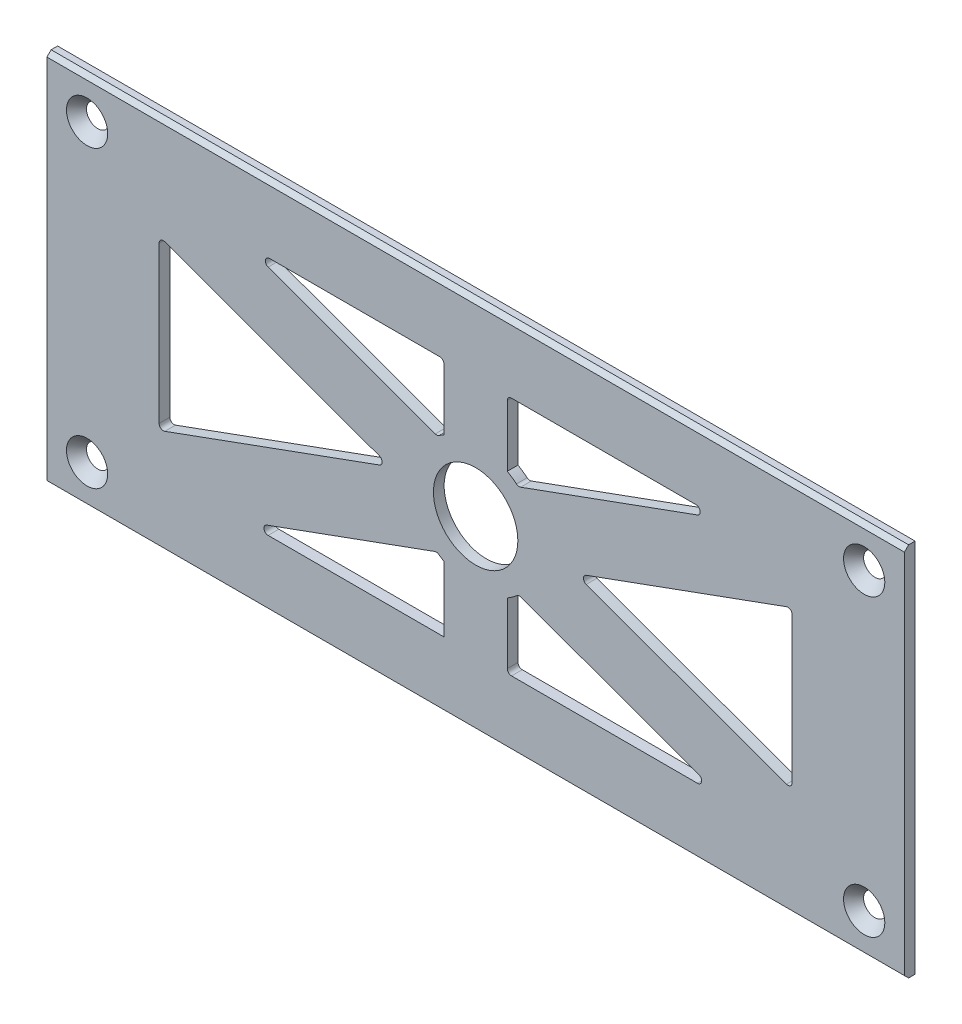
ISO-10303-21;
HEADER;
FILE_DESCRIPTION(('STEP AP214'),'2;1');
FILE_NAME('part.step','',(''),(''),'','','');
FILE_SCHEMA(('AUTOMOTIVE_DESIGN { 1 0 10303 214 1 1 1 1 }'));
ENDSEC;
DATA;
#1=APPLICATION_CONTEXT('core data for automotive mechanical design processes');
#2=APPLICATION_PROTOCOL_DEFINITION('international standard','automotive_design',2000,#1);
#3=PRODUCT_CONTEXT('',#1,'mechanical');
#4=PRODUCT('Part','Part','',(#3));
#5=PRODUCT_RELATED_PRODUCT_CATEGORY('part','',(#4));
#6=PRODUCT_DEFINITION_FORMATION('','',#4);
#7=PRODUCT_DEFINITION_CONTEXT('part definition',#1,'design');
#8=PRODUCT_DEFINITION('design','',#6,#7);
#9=PRODUCT_DEFINITION_SHAPE('','',#8);
#10=(LENGTH_UNIT() NAMED_UNIT(*) SI_UNIT(.MILLI.,.METRE.));
#11=(NAMED_UNIT(*) PLANE_ANGLE_UNIT() SI_UNIT($,.RADIAN.));
#12=(NAMED_UNIT(*) SI_UNIT($,.STERADIAN.) SOLID_ANGLE_UNIT());
#13=UNCERTAINTY_MEASURE_WITH_UNIT(LENGTH_MEASURE(1.E-05),#10,'distance_accuracy_value','');
#14=(GEOMETRIC_REPRESENTATION_CONTEXT(3) GLOBAL_UNCERTAINTY_ASSIGNED_CONTEXT((#13)) GLOBAL_UNIT_ASSIGNED_CONTEXT((#10,
#11,#12)) REPRESENTATION_CONTEXT('',''));
#15=CARTESIAN_POINT('',(0.,0.,0.));
#16=DIRECTION('',(0.,0.,1.));
#17=DIRECTION('',(1.,0.,0.));
#18=AXIS2_PLACEMENT_3D('',#15,#16,#17);
#19=CARTESIAN_POINT('',(0.,0.,1.27));
#20=DIRECTION('',(0.,0.,-1.));
#21=DIRECTION('',(-1.,0.,0.));
#22=AXIS2_PLACEMENT_3D('',#19,#20,#21);
#23=PLANE('',#22);
#24=DIRECTION('',(0.939692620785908,0.342020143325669,0.));
#25=VECTOR('',#24,1.);
#26=CARTESIAN_POINT('',(-2.38702555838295,6.55829882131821,1.27));
#27=LINE('',#26,#25);
#28=CARTESIAN_POINT('',(10.6450047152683,11.3015699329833,1.27));
#29=VERTEX_POINT('',#28);
#30=CARTESIAN_POINT('',(52.568041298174,26.5603073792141,1.27));
#31=VERTEX_POINT('',#30);
#32=EDGE_CURVE('E419',#29,#31,#27,.T.);
#33=ORIENTED_EDGE('',*,*,#32,.F.);
#34=CARTESIAN_POINT('',(10.3029845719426,12.2412625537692,1.27));
#35=DIRECTION('',(0.,0.,-1.));
#36=DIRECTION('',(-1.,0.,0.));
#37=AXIS2_PLACEMENT_3D('',#34,#35,#36);
#38=CIRCLE('',#37,1.);
#39=CARTESIAN_POINT('',(9.6590480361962,11.4761836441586,1.27));
#40=VERTEX_POINT('',#39);
#41=EDGE_CURVE('E416',#29,#40,#38,.T.);
#42=ORIENTED_EDGE('',*,*,#41,.T.);
#43=CARTESIAN_POINT('',(0.,0.,1.27));
#44=DIRECTION('',(0.,0.,1.));
#45=DIRECTION('',(1.,0.,0.));
#46=AXIS2_PLACEMENT_3D('',#43,#44,#45);
#47=CIRCLE('',#46,15.);
#48=CARTESIAN_POINT('',(7.5,12.9903810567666,1.27));
#49=VERTEX_POINT('',#48);
#50=EDGE_CURVE('E410',#40,#49,#47,.T.);
#51=ORIENTED_EDGE('',*,*,#50,.T.);
#52=DIRECTION('',(0.,1.,0.));
#53=VECTOR('',#52,1.);
#54=CARTESIAN_POINT('',(7.50000000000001,0.,1.27));
#55=LINE('',#54,#53);
#56=CARTESIAN_POINT('',(7.5,27.5,1.27));
#57=VERTEX_POINT('',#56);
#58=EDGE_CURVE('E415',#49,#57,#55,.T.);
#59=ORIENTED_EDGE('',*,*,#58,.T.);
#60=CARTESIAN_POINT('',(8.5,27.5,1.27));
#61=DIRECTION('',(0.,0.,-1.));
#62=DIRECTION('',(-1.,0.,0.));
#63=AXIS2_PLACEMENT_3D('',#60,#61,#62);
#64=CIRCLE('',#63,1.);
#65=CARTESIAN_POINT('',(8.5,28.5,1.27));
#66=VERTEX_POINT('',#65);
#67=EDGE_CURVE('E732',#57,#66,#64,.T.);
#68=ORIENTED_EDGE('',*,*,#67,.T.);
#69=DIRECTION('',(1.,0.,0.));
#70=VECTOR('',#69,1.);
#71=CARTESIAN_POINT('',(0.,28.5,1.27));
#72=LINE('',#71,#70);
#73=CARTESIAN_POINT('',(52.2260211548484,28.5,1.27));
#74=VERTEX_POINT('',#73);
#75=EDGE_CURVE('E436',#66,#74,#72,.T.);
#76=ORIENTED_EDGE('',*,*,#75,.T.);
#77=CARTESIAN_POINT('',(52.2260211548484,27.5,1.27));
#78=DIRECTION('',(0.,0.,-1.));
#79=DIRECTION('',(-1.,0.,0.));
#80=AXIS2_PLACEMENT_3D('',#77,#78,#79);
#81=CIRCLE('',#80,1.);
#82=EDGE_CURVE('E728',#74,#31,#81,.T.);
#83=ORIENTED_EDGE('',*,*,#82,.T.);
#84=EDGE_LOOP('',(#33,#42,#51,#59,#68,#76,#83));
#85=FACE_BOUND('',#84,.T.);
#86=DIRECTION('',(0.939692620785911,-0.342020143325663,0.));
#87=VECTOR('',#86,1.);
#88=CARTESIAN_POINT('',(2.78346320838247,7.64750231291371,1.27));
#89=LINE('',#88,#87);
#90=CARTESIAN_POINT('',(26.2048170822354,-0.877173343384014,1.27));
#91=VERTEX_POINT('',#90);
#92=CARTESIAN_POINT('',(73.6579798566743,-18.1487121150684,1.27));
#93=VERTEX_POINT('',#92);
#94=EDGE_CURVE('E459',#91,#93,#89,.T.);
#95=ORIENTED_EDGE('',*,*,#94,.F.);
#96=CARTESIAN_POINT('',(26.5468372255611,0.0625192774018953,1.27));
#97=DIRECTION('',(0.,0.,-1.));
#98=DIRECTION('',(-1.,0.,0.));
#99=AXIS2_PLACEMENT_3D('',#96,#97,#98);
#100=CIRCLE('',#99,1.);
#101=CARTESIAN_POINT('',(26.2048170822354,1.00221189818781,1.27));
#102=VERTEX_POINT('',#101);
#103=EDGE_CURVE('E724',#91,#102,#100,.T.);
#104=ORIENTED_EDGE('',*,*,#103,.T.);
#105=DIRECTION('',(0.939692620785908,0.342020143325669,0.));
#106=VECTOR('',#105,1.);
#107=CARTESIAN_POINT('',(2.74327659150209,-7.53709049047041,1.27));
#108=LINE('',#107,#106);
#109=CARTESIAN_POINT('',(73.6579798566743,18.2737506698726,1.27));
#110=VERTEX_POINT('',#109);
#111=EDGE_CURVE('E430',#102,#110,#108,.T.);
#112=ORIENTED_EDGE('',*,*,#111,.T.);
#113=CARTESIAN_POINT('',(74.,17.3340580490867,1.27));
#114=DIRECTION('',(0.,0.,-1.));
#115=DIRECTION('',(-1.,0.,0.));
#116=AXIS2_PLACEMENT_3D('',#113,#114,#115);
#117=CIRCLE('',#116,1.);
#118=CARTESIAN_POINT('',(75.,17.3340580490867,1.27));
#119=VERTEX_POINT('',#118);
#120=EDGE_CURVE('E720',#110,#119,#117,.T.);
#121=ORIENTED_EDGE('',*,*,#120,.T.);
#122=DIRECTION('',(0.,1.,0.));
#123=VECTOR('',#122,1.);
#124=CARTESIAN_POINT('',(75.,0.,1.27));
#125=LINE('',#124,#123);
#126=CARTESIAN_POINT('',(75.,-17.2090194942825,1.27));
#127=VERTEX_POINT('',#126);
#128=EDGE_CURVE('E462',#127,#119,#125,.T.);
#129=ORIENTED_EDGE('',*,*,#128,.F.);
#130=CARTESIAN_POINT('',(74.,-17.2090194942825,1.27));
#131=DIRECTION('',(0.,0.,-1.));
#132=DIRECTION('',(-1.,0.,0.));
#133=AXIS2_PLACEMENT_3D('',#130,#131,#132);
#134=CIRCLE('',#133,1.);
#135=EDGE_CURVE('E716',#127,#93,#134,.T.);
#136=ORIENTED_EDGE('',*,*,#135,.T.);
#137=EDGE_LOOP('',(#95,#104,#112,#121,#129,#136));
#138=FACE_BOUND('',#137,.T.);
#139=DIRECTION('',(-0.939692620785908,-0.342020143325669,0.));
#140=VECTOR('',#139,1.);
#141=CARTESIAN_POINT('',(2.74327659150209,-7.53709049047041,1.27));
#142=LINE('',#141,#140);
#143=CARTESIAN_POINT('',(-9.67436556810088,-12.056742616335,1.27));
#144=VERTEX_POINT('',#143);
#145=CARTESIAN_POINT('',(-49.5225822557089,-26.5603073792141,1.27));
#146=VERTEX_POINT('',#145);
#147=EDGE_CURVE('E482',#144,#146,#142,.T.);
#148=ORIENTED_EDGE('',*,*,#147,.F.);
#149=CARTESIAN_POINT('',(-9.33234542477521,-12.9964352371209,1.27));
#150=DIRECTION('',(0.,0.,-1.));
#151=DIRECTION('',(-1.,0.,0.));
#152=AXIS2_PLACEMENT_3D('',#149,#150,#151);
#153=CIRCLE('',#152,1.);
#154=CARTESIAN_POINT('',(-8.74907383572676,-12.1841580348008,1.27));
#155=VERTEX_POINT('',#154);
#156=EDGE_CURVE('E704',#144,#155,#153,.T.);
#157=ORIENTED_EDGE('',*,*,#156,.T.);
#158=CARTESIAN_POINT('',(0.,0.,1.27));
#159=DIRECTION('',(0.,0.,1.));
#160=DIRECTION('',(1.,0.,0.));
#161=AXIS2_PLACEMENT_3D('',#158,#159,#160);
#162=CIRCLE('',#161,15.);
#163=CARTESIAN_POINT('',(-7.5,-12.9903810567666,1.27));
#164=VERTEX_POINT('',#163);
#165=EDGE_CURVE('E480',#155,#164,#162,.T.);
#166=ORIENTED_EDGE('',*,*,#165,.T.);
#167=DIRECTION('',(0.,-1.,0.));
#168=VECTOR('',#167,1.);
#169=CARTESIAN_POINT('',(-7.5,0.,1.27));
#170=LINE('',#169,#168);
#171=CARTESIAN_POINT('',(-7.5,-28.5,1.27));
#172=VERTEX_POINT('',#171);
#173=EDGE_CURVE('E487',#164,#172,#170,.T.);
#174=ORIENTED_EDGE('',*,*,#173,.T.);
#175=DIRECTION('',(1.,0.,0.));
#176=VECTOR('',#175,1.);
#177=CARTESIAN_POINT('',(0.,-28.5,1.27));
#178=LINE('',#177,#176);
#179=CARTESIAN_POINT('',(-49.1805621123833,-28.5,1.27));
#180=VERTEX_POINT('',#179);
#181=EDGE_CURVE('E485',#180,#172,#178,.T.);
#182=ORIENTED_EDGE('',*,*,#181,.F.);
#183=CARTESIAN_POINT('',(-49.1805621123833,-27.5,1.27));
#184=DIRECTION('',(0.,0.,-1.));
#185=DIRECTION('',(-1.,0.,0.));
#186=AXIS2_PLACEMENT_3D('',#183,#184,#185);
#187=CIRCLE('',#186,1.);
#188=EDGE_CURVE('E696',#180,#146,#187,.T.);
#189=ORIENTED_EDGE('',*,*,#188,.T.);
#190=EDGE_LOOP('',(#148,#157,#166,#174,#182,#189));
#191=FACE_BOUND('',#190,.T.);
#192=CARTESIAN_POINT('',(-92.075,34.925,1.27));
#193=DIRECTION('',(0.,0.,1.));
#194=DIRECTION('',(1.,0.,0.));
#195=AXIS2_PLACEMENT_3D('',#192,#193,#194);
#196=CIRCLE('',#195,4.88950000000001);
#197=CARTESIAN_POINT('',(-87.1855,34.925,1.27));
#198=VERTEX_POINT('',#197);
#199=EDGE_CURVE('E494',#198,#198,#196,.T.);
#200=ORIENTED_EDGE('',*,*,#199,.F.);
#201=EDGE_LOOP('',(#200));
#202=FACE_BOUND('',#201,.T.);
#203=CARTESIAN_POINT('',(-92.075,-34.925,1.27));
#204=DIRECTION('',(0.,0.,1.));
#205=DIRECTION('',(1.,0.,0.));
#206=AXIS2_PLACEMENT_3D('',#203,#204,#205);
#207=CIRCLE('',#206,4.88950000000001);
#208=CARTESIAN_POINT('',(-87.1855,-34.925,1.27));
#209=VERTEX_POINT('',#208);
#210=EDGE_CURVE('E500',#209,#209,#207,.T.);
#211=ORIENTED_EDGE('',*,*,#210,.F.);
#212=EDGE_LOOP('',(#211));
#213=FACE_BOUND('',#212,.T.);
#214=CARTESIAN_POINT('',(92.075,-34.925,1.27));
#215=DIRECTION('',(0.,0.,1.));
#216=DIRECTION('',(1.,0.,0.));
#217=AXIS2_PLACEMENT_3D('',#214,#215,#216);
#218=CIRCLE('',#217,4.88950000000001);
#219=CARTESIAN_POINT('',(96.9645,-34.925,1.27));
#220=VERTEX_POINT('',#219);
#221=EDGE_CURVE('E504',#220,#220,#218,.T.);
#222=ORIENTED_EDGE('',*,*,#221,.F.);
#223=EDGE_LOOP('',(#222));
#224=FACE_BOUND('',#223,.T.);
#225=CARTESIAN_POINT('',(0.,0.,1.27));
#226=DIRECTION('',(0.,0.,1.));
#227=DIRECTION('',(1.,0.,0.));
#228=AXIS2_PLACEMENT_3D('',#225,#226,#227);
#229=CIRCLE('',#228,10.);
#230=CARTESIAN_POINT('',(9.99999999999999,0.,1.27));
#231=VERTEX_POINT('',#230);
#232=EDGE_CURVE('E515',#231,#231,#229,.T.);
#233=ORIENTED_EDGE('',*,*,#232,.F.);
#234=EDGE_LOOP('',(#233));
#235=FACE_BOUND('',#234,.T.);
#236=DIRECTION('',(0.,-1.,0.));
#237=VECTOR('',#236,1.);
#238=CARTESIAN_POINT('',(-101.6,-44.45,1.27));
#239=LINE('',#238,#237);
#240=CARTESIAN_POINT('',(-101.6,43.45,1.27));
#241=VERTEX_POINT('',#240);
#242=CARTESIAN_POINT('',(-101.6,-43.45,1.27));
#243=VERTEX_POINT('',#242);
#244=EDGE_CURVE('E524',#241,#243,#239,.T.);
#245=ORIENTED_EDGE('',*,*,#244,.T.);
#246=DIRECTION('',(1.,0.,0.));
#247=VECTOR('',#246,1.);
#248=CARTESIAN_POINT('',(0.,-43.45,1.27));
#249=LINE('',#248,#247);
#250=CARTESIAN_POINT('',(101.6,-43.45,1.27));
#251=VERTEX_POINT('',#250);
#252=EDGE_CURVE('E766',#243,#251,#249,.T.);
#253=ORIENTED_EDGE('',*,*,#252,.T.);
#254=DIRECTION('',(0.,1.,0.));
#255=VECTOR('',#254,1.);
#256=CARTESIAN_POINT('',(101.6,-44.45,1.27));
#257=LINE('',#256,#255);
#258=CARTESIAN_POINT('',(101.6,43.45,1.27));
#259=VERTEX_POINT('',#258);
#260=EDGE_CURVE('E521',#251,#259,#257,.T.);
#261=ORIENTED_EDGE('',*,*,#260,.T.);
#262=DIRECTION('',(-1.,0.,0.));
#263=VECTOR('',#262,1.);
#264=CARTESIAN_POINT('',(0.,43.45,1.27));
#265=LINE('',#264,#263);
#266=EDGE_CURVE('E763',#259,#241,#265,.T.);
#267=ORIENTED_EDGE('',*,*,#266,.T.);
#268=EDGE_LOOP('',(#245,#253,#261,#267));
#269=FACE_BOUND('',#268,.T.);
#270=CARTESIAN_POINT('',(92.075,34.925,1.27));
#271=DIRECTION('',(0.,0.,1.));
#272=DIRECTION('',(1.,0.,0.));
#273=AXIS2_PLACEMENT_3D('',#270,#271,#272);
#274=CIRCLE('',#273,4.88950000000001);
#275=CARTESIAN_POINT('',(96.9645,34.925,1.27));
#276=VERTEX_POINT('',#275);
#277=EDGE_CURVE('E508',#276,#276,#274,.T.);
#278=ORIENTED_EDGE('',*,*,#277,.F.);
#279=EDGE_LOOP('',(#278));
#280=FACE_BOUND('',#279,.T.);
#281=DIRECTION('',(0.939692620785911,-0.342020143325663,0.));
#282=VECTOR('',#281,1.);
#283=CARTESIAN_POINT('',(-2.34683894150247,-6.44788699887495,1.27));
#284=LINE('',#283,#282);
#285=CARTESIAN_POINT('',(-73.6579798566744,19.5072456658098,1.27));
#286=VERTEX_POINT('',#285);
#287=CARTESIAN_POINT('',(-22.8158174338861,1.00221189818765,1.27));
#288=VERTEX_POINT('',#287);
#289=EDGE_CURVE('E966',#286,#288,#284,.T.);
#290=ORIENTED_EDGE('',*,*,#289,.T.);
#291=CARTESIAN_POINT('',(-23.1578375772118,0.062519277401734,1.27));
#292=DIRECTION('',(0.,0.,-1.));
#293=DIRECTION('',(-1.,0.,0.));
#294=AXIS2_PLACEMENT_3D('',#291,#292,#293);
#295=CIRCLE('',#294,1.);
#296=CARTESIAN_POINT('',(-22.8158174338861,-0.877173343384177,1.27));
#297=VERTEX_POINT('',#296);
#298=EDGE_CURVE('E751',#288,#297,#295,.T.);
#299=ORIENTED_EDGE('',*,*,#298,.T.);
#300=DIRECTION('',(-0.939692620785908,-0.342020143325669,0.));
#301=VECTOR('',#300,1.);
#302=CARTESIAN_POINT('',(-2.38702555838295,6.55829882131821,1.27));
#303=LINE('',#302,#301);
#304=CARTESIAN_POINT('',(-73.6579798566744,-19.3822071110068,1.27));
#305=VERTEX_POINT('',#304);
#306=EDGE_CURVE('E1372',#297,#305,#303,.T.);
#307=ORIENTED_EDGE('',*,*,#306,.T.);
#308=CARTESIAN_POINT('',(-74.,-18.4425144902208,1.27));
#309=DIRECTION('',(0.,0.,-1.));
#310=DIRECTION('',(-1.,0.,0.));
#311=AXIS2_PLACEMENT_3D('',#308,#309,#310);
#312=CIRCLE('',#311,1.);
#313=CARTESIAN_POINT('',(-75.,-18.4425144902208,1.27));
#314=VERTEX_POINT('',#313);
#315=EDGE_CURVE('E755',#305,#314,#312,.T.);
#316=ORIENTED_EDGE('',*,*,#315,.T.);
#317=DIRECTION('',(0.,1.,0.));
#318=VECTOR('',#317,1.);
#319=CARTESIAN_POINT('',(-75.,0.,1.27));
#320=LINE('',#319,#318);
#321=CARTESIAN_POINT('',(-75.,18.5675530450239,1.27));
#322=VERTEX_POINT('',#321);
#323=EDGE_CURVE('E446',#314,#322,#320,.T.);
#324=ORIENTED_EDGE('',*,*,#323,.T.);
#325=CARTESIAN_POINT('',(-74.,18.5675530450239,1.27));
#326=DIRECTION('',(0.,0.,-1.));
#327=DIRECTION('',(-1.,0.,0.));
#328=AXIS2_PLACEMENT_3D('',#325,#326,#327);
#329=CIRCLE('',#328,1.);
#330=EDGE_CURVE('E759',#322,#286,#329,.T.);
#331=ORIENTED_EDGE('',*,*,#330,.T.);
#332=EDGE_LOOP('',(#290,#299,#307,#316,#324,#331));
#333=FACE_BOUND('',#332,.T.);
#334=CARTESIAN_POINT('',(0.,0.,1.27));
#335=DIRECTION('',(0.,0.,1.));
#336=DIRECTION('',(1.,0.,0.));
#337=AXIS2_PLACEMENT_3D('',#334,#335,#336);
#338=CIRCLE('',#337,15.);
#339=CARTESIAN_POINT('',(7.5,-12.9903810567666,1.27));
#340=VERTEX_POINT('',#339);
#341=CARTESIAN_POINT('',(9.75569736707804,-11.3941374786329,1.27));
#342=VERTEX_POINT('',#341);
#343=EDGE_CURVE('E465',#340,#342,#338,.T.);
#344=ORIENTED_EDGE('',*,*,#343,.T.);
#345=CARTESIAN_POINT('',(10.4060771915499,-12.1537466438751,1.27));
#346=DIRECTION('',(0.,0.,-1.));
#347=DIRECTION('',(-1.,0.,0.));
#348=AXIS2_PLACEMENT_3D('',#345,#346,#347);
#349=CIRCLE('',#348,1.);
#350=CARTESIAN_POINT('',(10.7480973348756,-11.2140540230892,1.27));
#351=VERTEX_POINT('',#350);
#352=EDGE_CURVE('E708',#342,#351,#349,.T.);
#353=ORIENTED_EDGE('',*,*,#352,.T.);
#354=DIRECTION('',(0.939692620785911,-0.342020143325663,0.));
#355=VECTOR('',#354,1.);
#356=CARTESIAN_POINT('',(-2.34683894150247,-6.44788699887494,1.27));
#357=LINE('',#356,#355);
#358=CARTESIAN_POINT('',(52.9115819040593,-26.5603073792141,1.27));
#359=VERTEX_POINT('',#358);
#360=EDGE_CURVE('E474',#351,#359,#357,.T.);
#361=ORIENTED_EDGE('',*,*,#360,.T.);
#362=CARTESIAN_POINT('',(52.5695617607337,-27.5,1.27));
#363=DIRECTION('',(0.,0.,-1.));
#364=DIRECTION('',(-1.,0.,0.));
#365=AXIS2_PLACEMENT_3D('',#362,#363,#364);
#366=CIRCLE('',#365,1.);
#367=CARTESIAN_POINT('',(52.5695617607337,-28.5,1.27));
#368=VERTEX_POINT('',#367);
#369=EDGE_CURVE('E712',#359,#368,#366,.T.);
#370=ORIENTED_EDGE('',*,*,#369,.T.);
#371=DIRECTION('',(1.,0.,0.));
#372=VECTOR('',#371,1.);
#373=CARTESIAN_POINT('',(0.,-28.5,1.27));
#374=LINE('',#373,#372);
#375=CARTESIAN_POINT('',(8.5,-28.5,1.27));
#376=VERTEX_POINT('',#375);
#377=EDGE_CURVE('E471',#376,#368,#374,.T.);
#378=ORIENTED_EDGE('',*,*,#377,.F.);
#379=CARTESIAN_POINT('',(8.5,-27.5,1.27));
#380=DIRECTION('',(0.,0.,-1.));
#381=DIRECTION('',(-1.,0.,0.));
#382=AXIS2_PLACEMENT_3D('',#379,#380,#381);
#383=CIRCLE('',#382,1.);
#384=CARTESIAN_POINT('',(7.5,-27.5,1.27));
#385=VERTEX_POINT('',#384);
#386=EDGE_CURVE('E700',#376,#385,#383,.T.);
#387=ORIENTED_EDGE('',*,*,#386,.T.);
#388=DIRECTION('',(0.,-1.,0.));
#389=VECTOR('',#388,1.);
#390=CARTESIAN_POINT('',(7.5,0.,1.27));
#391=LINE('',#390,#389);
#392=EDGE_CURVE('E468',#340,#385,#391,.T.);
#393=ORIENTED_EDGE('',*,*,#392,.F.);
#394=EDGE_LOOP('',(#344,#353,#361,#370,#378,#387,#393));
#395=FACE_BOUND('',#394,.T.);
#396=CARTESIAN_POINT('',(0.,0.,1.27));
#397=DIRECTION('',(0.,0.,1.));
#398=DIRECTION('',(1.,0.,0.));
#399=AXIS2_PLACEMENT_3D('',#396,#397,#398);
#400=CIRCLE('',#399,15.);
#401=CARTESIAN_POINT('',(-7.5,12.9903810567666,1.27));
#402=VERTEX_POINT('',#401);
#403=CARTESIAN_POINT('',(-8.64005927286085,12.2617036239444,1.27));
#404=VERTEX_POINT('',#403);
#405=EDGE_CURVE('E442',#402,#404,#400,.T.);
#406=ORIENTED_EDGE('',*,*,#405,.T.);
#407=CARTESIAN_POINT('',(-9.21606322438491,13.0791505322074,1.27));
#408=DIRECTION('',(0.,0.,-1.));
#409=DIRECTION('',(-1.,0.,0.));
#410=AXIS2_PLACEMENT_3D('',#407,#408,#409);
#411=CIRCLE('',#410,1.);
#412=CARTESIAN_POINT('',(-9.55808336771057,12.1394579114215,1.27));
#413=VERTEX_POINT('',#412);
#414=EDGE_CURVE('E747',#404,#413,#411,.T.);
#415=ORIENTED_EDGE('',*,*,#414,.T.);
#416=DIRECTION('',(-0.939692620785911,0.342020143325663,0.));
#417=VECTOR('',#416,1.);
#418=CARTESIAN_POINT('',(2.78346320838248,7.64750231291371,1.27));
#419=LINE('',#418,#417);
#420=CARTESIAN_POINT('',(-49.1790416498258,26.5603073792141,1.27));
#421=VERTEX_POINT('',#420);
#422=EDGE_CURVE('E452',#413,#421,#419,.T.);
#423=ORIENTED_EDGE('',*,*,#422,.T.);
#424=CARTESIAN_POINT('',(-48.8370215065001,27.5,1.27));
#425=DIRECTION('',(0.,0.,-1.));
#426=DIRECTION('',(-1.,0.,0.));
#427=AXIS2_PLACEMENT_3D('',#424,#425,#426);
#428=CIRCLE('',#427,1.);
#429=CARTESIAN_POINT('',(-48.8370215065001,28.5,1.27));
#430=VERTEX_POINT('',#429);
#431=EDGE_CURVE('E739',#421,#430,#428,.T.);
#432=ORIENTED_EDGE('',*,*,#431,.T.);
#433=DIRECTION('',(1.,0.,0.));
#434=VECTOR('',#433,1.);
#435=CARTESIAN_POINT('',(0.,28.5,1.27));
#436=LINE('',#435,#434);
#437=CARTESIAN_POINT('',(-8.5,28.5,1.27));
#438=VERTEX_POINT('',#437);
#439=EDGE_CURVE('E449',#430,#438,#436,.T.);
#440=ORIENTED_EDGE('',*,*,#439,.T.);
#441=CARTESIAN_POINT('',(-8.5,27.5,1.27));
#442=DIRECTION('',(0.,0.,-1.));
#443=DIRECTION('',(-1.,0.,0.));
#444=AXIS2_PLACEMENT_3D('',#441,#442,#443);
#445=CIRCLE('',#444,1.);
#446=CARTESIAN_POINT('',(-7.5,27.5,1.27));
#447=VERTEX_POINT('',#446);
#448=EDGE_CURVE('E743',#438,#447,#445,.T.);
#449=ORIENTED_EDGE('',*,*,#448,.T.);
#450=DIRECTION('',(0.,1.,0.));
#451=VECTOR('',#450,1.);
#452=CARTESIAN_POINT('',(-7.5,0.,1.27));
#453=LINE('',#452,#451);
#454=EDGE_CURVE('E445',#402,#447,#453,.T.);
#455=ORIENTED_EDGE('',*,*,#454,.F.);
#456=EDGE_LOOP('',(#406,#415,#423,#432,#440,#449,#455));
#457=FACE_BOUND('',#456,.T.);
#458=ADVANCED_FACE('F122',(#85,#138,#191,#202,#213,#224,#235,#269,#280,#333,#395,#457),#23,.F.);
#459=CARTESIAN_POINT('',(0.,0.,-1.27));
#460=DIRECTION('',(0.,0.,-1.));
#461=DIRECTION('',(-1.,0.,0.));
#462=AXIS2_PLACEMENT_3D('',#459,#460,#461);
#463=PLANE('',#462);
#464=CARTESIAN_POINT('',(-92.075,34.925,-1.27));
#465=DIRECTION('',(0.,0.,-1.));
#466=DIRECTION('',(-1.,0.,0.));
#467=AXIS2_PLACEMENT_3D('',#464,#465,#466);
#468=CIRCLE('',#467,2.68151168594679);
#469=CARTESIAN_POINT('',(-94.7565116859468,34.925,-1.27));
#470=VERTEX_POINT('',#469);
#471=EDGE_CURVE('E499',#470,#470,#468,.T.);
#472=ORIENTED_EDGE('',*,*,#471,.F.);
#473=EDGE_LOOP('',(#472));
#474=FACE_BOUND('',#473,.T.);
#475=CARTESIAN_POINT('',(-92.075,-34.925,-1.27));
#476=DIRECTION('',(0.,0.,-1.));
#477=DIRECTION('',(-1.,0.,0.));
#478=AXIS2_PLACEMENT_3D('',#475,#476,#477);
#479=CIRCLE('',#478,2.68151168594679);
#480=CARTESIAN_POINT('',(-94.7565116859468,-34.925,-1.27));
#481=VERTEX_POINT('',#480);
#482=EDGE_CURVE('E503',#481,#481,#479,.T.);
#483=ORIENTED_EDGE('',*,*,#482,.F.);
#484=EDGE_LOOP('',(#483));
#485=FACE_BOUND('',#484,.T.);
#486=CARTESIAN_POINT('',(92.075,-34.925,-1.27));
#487=DIRECTION('',(0.,0.,-1.));
#488=DIRECTION('',(-1.,0.,0.));
#489=AXIS2_PLACEMENT_3D('',#486,#487,#488);
#490=CIRCLE('',#489,2.68151168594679);
#491=CARTESIAN_POINT('',(89.3934883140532,-34.925,-1.27));
#492=VERTEX_POINT('',#491);
#493=EDGE_CURVE('E507',#492,#492,#490,.T.);
#494=ORIENTED_EDGE('',*,*,#493,.F.);
#495=EDGE_LOOP('',(#494));
#496=FACE_BOUND('',#495,.T.);
#497=CARTESIAN_POINT('',(92.075,34.925,-1.27));
#498=DIRECTION('',(0.,0.,-1.));
#499=DIRECTION('',(-1.,0.,0.));
#500=AXIS2_PLACEMENT_3D('',#497,#498,#499);
#501=CIRCLE('',#500,2.68151168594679);
#502=CARTESIAN_POINT('',(89.3934883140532,34.925,-1.27));
#503=VERTEX_POINT('',#502);
#504=EDGE_CURVE('E511',#503,#503,#501,.T.);
#505=ORIENTED_EDGE('',*,*,#504,.F.);
#506=EDGE_LOOP('',(#505));
#507=FACE_BOUND('',#506,.T.);
#508=DIRECTION('',(0.,1.,0.));
#509=VECTOR('',#508,1.);
#510=CARTESIAN_POINT('',(101.6,-44.45,-1.27));
#511=LINE('',#510,#509);
#512=CARTESIAN_POINT('',(101.6,-44.45,-1.27));
#513=VERTEX_POINT('',#512);
#514=CARTESIAN_POINT('',(101.6,44.45,-1.27));
#515=VERTEX_POINT('',#514);
#516=EDGE_CURVE('E518',#513,#515,#511,.T.);
#517=ORIENTED_EDGE('',*,*,#516,.F.);
#518=DIRECTION('',(1.,0.,0.));
#519=VECTOR('',#518,1.);
#520=CARTESIAN_POINT('',(-101.6,-44.45,-1.27));
#521=LINE('',#520,#519);
#522=CARTESIAN_POINT('',(-101.6,-44.45,-1.27));
#523=VERTEX_POINT('',#522);
#524=EDGE_CURVE('E525',#523,#513,#521,.T.);
#525=ORIENTED_EDGE('',*,*,#524,.F.);
#526=DIRECTION('',(0.,-1.,0.));
#527=VECTOR('',#526,1.);
#528=CARTESIAN_POINT('',(-101.6,-44.45,-1.27));
#529=LINE('',#528,#527);
#530=CARTESIAN_POINT('',(-101.6,44.45,-1.27));
#531=VERTEX_POINT('',#530);
#532=EDGE_CURVE('E534',#531,#523,#529,.T.);
#533=ORIENTED_EDGE('',*,*,#532,.F.);
#534=DIRECTION('',(-1.,0.,0.));
#535=VECTOR('',#534,1.);
#536=CARTESIAN_POINT('',(-101.6,44.45,-1.27));
#537=LINE('',#536,#535);
#538=EDGE_CURVE('E531',#515,#531,#537,.T.);
#539=ORIENTED_EDGE('',*,*,#538,.F.);
#540=EDGE_LOOP('',(#517,#525,#533,#539));
#541=FACE_BOUND('',#540,.T.);
#542=CARTESIAN_POINT('',(0.,0.,-1.27));
#543=DIRECTION('',(0.,0.,1.));
#544=DIRECTION('',(1.,0.,0.));
#545=AXIS2_PLACEMENT_3D('',#542,#543,#544);
#546=CIRCLE('',#545,10.);
#547=CARTESIAN_POINT('',(9.99999999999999,0.,-1.27));
#548=VERTEX_POINT('',#547);
#549=EDGE_CURVE('E514',#548,#548,#546,.T.);
#550=ORIENTED_EDGE('',*,*,#549,.T.);
#551=EDGE_LOOP('',(#550));
#552=FACE_BOUND('',#551,.T.);
#553=DIRECTION('',(0.,1.,0.));
#554=VECTOR('',#553,1.);
#555=CARTESIAN_POINT('',(-7.5,0.,-1.27));
#556=LINE('',#555,#554);
#557=CARTESIAN_POINT('',(-7.5,-28.5,-1.27));
#558=VERTEX_POINT('',#557);
#559=CARTESIAN_POINT('',(-7.5,-12.9903810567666,-1.27));
#560=VERTEX_POINT('',#559);
#561=EDGE_CURVE('E558',#558,#560,#556,.T.);
#562=ORIENTED_EDGE('',*,*,#561,.T.);
#563=CARTESIAN_POINT('',(0.,0.,-1.27));
#564=DIRECTION('',(0.,0.,-1.));
#565=DIRECTION('',(-1.,0.,0.));
#566=AXIS2_PLACEMENT_3D('',#563,#564,#565);
#567=CIRCLE('',#566,15.);
#568=CARTESIAN_POINT('',(-8.74907383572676,-12.1841580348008,-1.27));
#569=VERTEX_POINT('',#568);
#570=EDGE_CURVE('E561',#560,#569,#567,.T.);
#571=ORIENTED_EDGE('',*,*,#570,.T.);
#572=CARTESIAN_POINT('',(-9.33234542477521,-12.9964352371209,-1.27));
#573=DIRECTION('',(0.,0.,-1.));
#574=DIRECTION('',(-1.,0.,0.));
#575=AXIS2_PLACEMENT_3D('',#572,#573,#574);
#576=CIRCLE('',#575,1.);
#577=CARTESIAN_POINT('',(-9.67436556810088,-12.056742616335,-1.27));
#578=VERTEX_POINT('',#577);
#579=EDGE_CURVE('E706',#569,#578,#576,.F.);
#580=ORIENTED_EDGE('',*,*,#579,.T.);
#581=DIRECTION('',(0.939692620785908,0.342020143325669,0.));
#582=VECTOR('',#581,1.);
#583=CARTESIAN_POINT('',(2.74327659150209,-7.53709049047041,-1.27));
#584=LINE('',#583,#582);
#585=CARTESIAN_POINT('',(-49.5225822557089,-26.5603073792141,-1.27));
#586=VERTEX_POINT('',#585);
#587=EDGE_CURVE('E546',#586,#578,#584,.T.);
#588=ORIENTED_EDGE('',*,*,#587,.F.);
#589=CARTESIAN_POINT('',(-49.1805621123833,-27.5,-1.27));
#590=DIRECTION('',(0.,0.,-1.));
#591=DIRECTION('',(-1.,0.,0.));
#592=AXIS2_PLACEMENT_3D('',#589,#590,#591);
#593=CIRCLE('',#592,1.);
#594=CARTESIAN_POINT('',(-49.1805621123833,-28.5,-1.27));
#595=VERTEX_POINT('',#594);
#596=EDGE_CURVE('E698',#586,#595,#593,.F.);
#597=ORIENTED_EDGE('',*,*,#596,.T.);
#598=DIRECTION('',(-1.,0.,0.));
#599=VECTOR('',#598,1.);
#600=CARTESIAN_POINT('',(0.,-28.5,-1.27));
#601=LINE('',#600,#599);
#602=EDGE_CURVE('E555',#558,#595,#601,.T.);
#603=ORIENTED_EDGE('',*,*,#602,.F.);
#604=EDGE_LOOP('',(#562,#571,#580,#588,#597,#603));
#605=FACE_BOUND('',#604,.T.);
#606=DIRECTION('',(-0.93969262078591,0.342020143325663,0.));
#607=VECTOR('',#606,1.);
#608=CARTESIAN_POINT('',(-2.34683894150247,-6.44788699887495,-1.27));
#609=LINE('',#608,#607);
#610=CARTESIAN_POINT('',(-22.8158174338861,1.00221189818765,-1.27));
#611=VERTEX_POINT('',#610);
#612=CARTESIAN_POINT('',(-73.6579798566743,19.5072456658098,-1.27));
#613=VERTEX_POINT('',#612);
#614=EDGE_CURVE('E564',#611,#613,#609,.T.);
#615=ORIENTED_EDGE('',*,*,#614,.T.);
#616=CARTESIAN_POINT('',(-74.,18.5675530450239,-1.27));
#617=DIRECTION('',(0.,0.,-1.));
#618=DIRECTION('',(-1.,0.,0.));
#619=AXIS2_PLACEMENT_3D('',#616,#617,#618);
#620=CIRCLE('',#619,1.);
#621=CARTESIAN_POINT('',(-75.,18.5675530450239,-1.27));
#622=VERTEX_POINT('',#621);
#623=EDGE_CURVE('E761',#613,#622,#620,.F.);
#624=ORIENTED_EDGE('',*,*,#623,.T.);
#625=DIRECTION('',(0.,-1.,0.));
#626=VECTOR('',#625,1.);
#627=CARTESIAN_POINT('',(-75.,0.,-1.27));
#628=LINE('',#627,#626);
#629=CARTESIAN_POINT('',(-75.,-18.4425144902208,-1.27));
#630=VERTEX_POINT('',#629);
#631=EDGE_CURVE('E567',#622,#630,#628,.T.);
#632=ORIENTED_EDGE('',*,*,#631,.T.);
#633=CARTESIAN_POINT('',(-74.,-18.4425144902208,-1.27));
#634=DIRECTION('',(0.,0.,-1.));
#635=DIRECTION('',(-1.,0.,0.));
#636=AXIS2_PLACEMENT_3D('',#633,#634,#635);
#637=CIRCLE('',#636,1.);
#638=CARTESIAN_POINT('',(-73.6579798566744,-19.3822071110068,-1.27));
#639=VERTEX_POINT('',#638);
#640=EDGE_CURVE('E757',#630,#639,#637,.F.);
#641=ORIENTED_EDGE('',*,*,#640,.T.);
#642=DIRECTION('',(0.939692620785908,0.342020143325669,0.));
#643=VECTOR('',#642,1.);
#644=CARTESIAN_POINT('',(-2.38702555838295,6.55829882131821,-1.27));
#645=LINE('',#644,#643);
#646=CARTESIAN_POINT('',(-22.8158174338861,-0.877173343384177,-1.27));
#647=VERTEX_POINT('',#646);
#648=EDGE_CURVE('E570',#639,#647,#645,.T.);
#649=ORIENTED_EDGE('',*,*,#648,.T.);
#650=CARTESIAN_POINT('',(-23.1578375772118,0.062519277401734,-1.27));
#651=DIRECTION('',(0.,0.,-1.));
#652=DIRECTION('',(-1.,0.,0.));
#653=AXIS2_PLACEMENT_3D('',#650,#651,#652);
#654=CIRCLE('',#653,1.);
#655=EDGE_CURVE('E753',#647,#611,#654,.F.);
#656=ORIENTED_EDGE('',*,*,#655,.T.);
#657=EDGE_LOOP('',(#615,#624,#632,#641,#649,#656));
#658=FACE_BOUND('',#657,.T.);
#659=DIRECTION('',(0.,-1.,0.));
#660=VECTOR('',#659,1.);
#661=CARTESIAN_POINT('',(75.,0.,-1.27));
#662=LINE('',#661,#660);
#663=CARTESIAN_POINT('',(75.,17.3340580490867,-1.27));
#664=VERTEX_POINT('',#663);
#665=CARTESIAN_POINT('',(75.,-17.2090194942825,-1.27));
#666=VERTEX_POINT('',#665);
#667=EDGE_CURVE('E576',#664,#666,#662,.T.);
#668=ORIENTED_EDGE('',*,*,#667,.F.);
#669=CARTESIAN_POINT('',(74.,17.3340580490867,-1.27));
#670=DIRECTION('',(0.,0.,-1.));
#671=DIRECTION('',(-1.,0.,0.));
#672=AXIS2_PLACEMENT_3D('',#669,#670,#671);
#673=CIRCLE('',#672,1.);
#674=CARTESIAN_POINT('',(73.6579798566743,18.2737506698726,-1.27));
#675=VERTEX_POINT('',#674);
#676=EDGE_CURVE('E722',#664,#675,#673,.F.);
#677=ORIENTED_EDGE('',*,*,#676,.T.);
#678=DIRECTION('',(-0.939692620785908,-0.342020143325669,0.));
#679=VECTOR('',#678,1.);
#680=CARTESIAN_POINT('',(2.74327659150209,-7.53709049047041,-1.27));
#681=LINE('',#680,#679);
#682=CARTESIAN_POINT('',(26.2048170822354,1.0022118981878,-1.27));
#683=VERTEX_POINT('',#682);
#684=EDGE_CURVE('E579',#675,#683,#681,.T.);
#685=ORIENTED_EDGE('',*,*,#684,.T.);
#686=CARTESIAN_POINT('',(26.5468372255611,0.0625192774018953,-1.27));
#687=DIRECTION('',(0.,0.,-1.));
#688=DIRECTION('',(-1.,0.,0.));
#689=AXIS2_PLACEMENT_3D('',#686,#687,#688);
#690=CIRCLE('',#689,1.);
#691=CARTESIAN_POINT('',(26.2048170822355,-0.877173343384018,-1.27));
#692=VERTEX_POINT('',#691);
#693=EDGE_CURVE('E726',#683,#692,#690,.F.);
#694=ORIENTED_EDGE('',*,*,#693,.T.);
#695=DIRECTION('',(-0.939692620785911,0.342020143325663,0.));
#696=VECTOR('',#695,1.);
#697=CARTESIAN_POINT('',(2.78346320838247,7.64750231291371,-1.27));
#698=LINE('',#697,#696);
#699=CARTESIAN_POINT('',(73.6579798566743,-18.1487121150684,-1.27));
#700=VERTEX_POINT('',#699);
#701=EDGE_CURVE('E573',#700,#692,#698,.T.);
#702=ORIENTED_EDGE('',*,*,#701,.F.);
#703=CARTESIAN_POINT('',(74.,-17.2090194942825,-1.27));
#704=DIRECTION('',(0.,0.,-1.));
#705=DIRECTION('',(-1.,0.,0.));
#706=AXIS2_PLACEMENT_3D('',#703,#704,#705);
#707=CIRCLE('',#706,1.);
#708=EDGE_CURVE('E718',#700,#666,#707,.F.);
#709=ORIENTED_EDGE('',*,*,#708,.T.);
#710=EDGE_LOOP('',(#668,#677,#685,#694,#702,#709));
#711=FACE_BOUND('',#710,.T.);
#712=DIRECTION('',(-1.,0.,0.));
#713=VECTOR('',#712,1.);
#714=CARTESIAN_POINT('',(0.,-28.5,-1.27));
#715=LINE('',#714,#713);
#716=CARTESIAN_POINT('',(52.5695617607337,-28.5,-1.27));
#717=VERTEX_POINT('',#716);
#718=CARTESIAN_POINT('',(8.5,-28.5,-1.27));
#719=VERTEX_POINT('',#718);
#720=EDGE_CURVE('E585',#717,#719,#715,.T.);
#721=ORIENTED_EDGE('',*,*,#720,.F.);
#722=CARTESIAN_POINT('',(52.5695617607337,-27.5,-1.27));
#723=DIRECTION('',(0.,0.,-1.));
#724=DIRECTION('',(-1.,0.,0.));
#725=AXIS2_PLACEMENT_3D('',#722,#723,#724);
#726=CIRCLE('',#725,1.);
#727=CARTESIAN_POINT('',(52.9115819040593,-26.5603073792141,-1.27));
#728=VERTEX_POINT('',#727);
#729=EDGE_CURVE('E714',#717,#728,#726,.F.);
#730=ORIENTED_EDGE('',*,*,#729,.T.);
#731=DIRECTION('',(-0.93969262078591,0.342020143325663,0.));
#732=VECTOR('',#731,1.);
#733=CARTESIAN_POINT('',(-2.34683894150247,-6.44788699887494,-1.27));
#734=LINE('',#733,#732);
#735=CARTESIAN_POINT('',(10.7480973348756,-11.2140540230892,-1.27));
#736=VERTEX_POINT('',#735);
#737=EDGE_CURVE('E588',#728,#736,#734,.T.);
#738=ORIENTED_EDGE('',*,*,#737,.T.);
#739=CARTESIAN_POINT('',(10.4060771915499,-12.1537466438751,-1.27));
#740=DIRECTION('',(0.,0.,-1.));
#741=DIRECTION('',(-1.,0.,0.));
#742=AXIS2_PLACEMENT_3D('',#739,#740,#741);
#743=CIRCLE('',#742,1.);
#744=CARTESIAN_POINT('',(9.75569736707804,-11.3941374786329,-1.27));
#745=VERTEX_POINT('',#744);
#746=EDGE_CURVE('E710',#736,#745,#743,.F.);
#747=ORIENTED_EDGE('',*,*,#746,.T.);
#748=CARTESIAN_POINT('',(0.,0.,-1.27));
#749=DIRECTION('',(0.,0.,-1.));
#750=DIRECTION('',(-1.,0.,0.));
#751=AXIS2_PLACEMENT_3D('',#748,#749,#750);
#752=CIRCLE('',#751,15.);
#753=CARTESIAN_POINT('',(7.5,-12.9903810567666,-1.27));
#754=VERTEX_POINT('',#753);
#755=EDGE_CURVE('E591',#745,#754,#752,.T.);
#756=ORIENTED_EDGE('',*,*,#755,.T.);
#757=DIRECTION('',(0.,1.,0.));
#758=VECTOR('',#757,1.);
#759=CARTESIAN_POINT('',(7.5,0.,-1.27));
#760=LINE('',#759,#758);
#761=CARTESIAN_POINT('',(7.5,-27.5,-1.27));
#762=VERTEX_POINT('',#761);
#763=EDGE_CURVE('E582',#762,#754,#760,.T.);
#764=ORIENTED_EDGE('',*,*,#763,.F.);
#765=CARTESIAN_POINT('',(8.5,-27.5,-1.27));
#766=DIRECTION('',(0.,0.,-1.));
#767=DIRECTION('',(-1.,0.,0.));
#768=AXIS2_PLACEMENT_3D('',#765,#766,#767);
#769=CIRCLE('',#768,1.);
#770=EDGE_CURVE('E702',#762,#719,#769,.F.);
#771=ORIENTED_EDGE('',*,*,#770,.T.);
#772=EDGE_LOOP('',(#721,#730,#738,#747,#756,#764,#771));
#773=FACE_BOUND('',#772,.T.);
#774=DIRECTION('',(-1.,0.,0.));
#775=VECTOR('',#774,1.);
#776=CARTESIAN_POINT('',(0.,28.5,-1.27));
#777=LINE('',#776,#775);
#778=CARTESIAN_POINT('',(52.2260211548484,28.5,-1.27));
#779=VERTEX_POINT('',#778);
#780=CARTESIAN_POINT('',(8.5,28.5,-1.27));
#781=VERTEX_POINT('',#780);
#782=EDGE_CURVE('E596',#779,#781,#777,.T.);
#783=ORIENTED_EDGE('',*,*,#782,.T.);
#784=CARTESIAN_POINT('',(8.5,27.5,-1.27));
#785=DIRECTION('',(0.,0.,-1.));
#786=DIRECTION('',(-1.,0.,0.));
#787=AXIS2_PLACEMENT_3D('',#784,#785,#786);
#788=CIRCLE('',#787,1.);
#789=CARTESIAN_POINT('',(7.5,27.5,-1.27));
#790=VERTEX_POINT('',#789);
#791=EDGE_CURVE('E734',#781,#790,#788,.F.);
#792=ORIENTED_EDGE('',*,*,#791,.T.);
#793=DIRECTION('',(0.,-1.,0.));
#794=VECTOR('',#793,1.);
#795=CARTESIAN_POINT('',(7.50000000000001,0.,-1.27));
#796=LINE('',#795,#794);
#797=CARTESIAN_POINT('',(7.5,12.9903810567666,-1.27));
#798=VERTEX_POINT('',#797);
#799=EDGE_CURVE('E599',#790,#798,#796,.T.);
#800=ORIENTED_EDGE('',*,*,#799,.T.);
#801=CARTESIAN_POINT('',(0.,0.,-1.27));
#802=DIRECTION('',(0.,0.,-1.));
#803=DIRECTION('',(-1.,0.,0.));
#804=AXIS2_PLACEMENT_3D('',#801,#802,#803);
#805=CIRCLE('',#804,15.);
#806=CARTESIAN_POINT('',(9.6590480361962,11.4761836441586,-1.27));
#807=VERTEX_POINT('',#806);
#808=EDGE_CURVE('E427',#798,#807,#805,.T.);
#809=ORIENTED_EDGE('',*,*,#808,.T.);
#810=CARTESIAN_POINT('',(10.3029845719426,12.2412625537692,-1.27));
#811=DIRECTION('',(0.,0.,-1.));
#812=DIRECTION('',(-1.,0.,0.));
#813=AXIS2_PLACEMENT_3D('',#810,#811,#812);
#814=CIRCLE('',#813,1.);
#815=CARTESIAN_POINT('',(10.6450047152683,11.3015699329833,-1.27));
#816=VERTEX_POINT('',#815);
#817=EDGE_CURVE('E737',#807,#816,#814,.F.);
#818=ORIENTED_EDGE('',*,*,#817,.T.);
#819=DIRECTION('',(-0.939692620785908,-0.342020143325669,0.));
#820=VECTOR('',#819,1.);
#821=CARTESIAN_POINT('',(-2.38702555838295,6.55829882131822,-1.27));
#822=LINE('',#821,#820);
#823=CARTESIAN_POINT('',(52.568041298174,26.5603073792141,-1.27));
#824=VERTEX_POINT('',#823);
#825=EDGE_CURVE('E593',#824,#816,#822,.T.);
#826=ORIENTED_EDGE('',*,*,#825,.F.);
#827=CARTESIAN_POINT('',(52.2260211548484,27.5,-1.27));
#828=DIRECTION('',(0.,0.,-1.));
#829=DIRECTION('',(-1.,0.,0.));
#830=AXIS2_PLACEMENT_3D('',#827,#828,#829);
#831=CIRCLE('',#830,1.);
#832=EDGE_CURVE('E730',#824,#779,#831,.F.);
#833=ORIENTED_EDGE('',*,*,#832,.T.);
#834=EDGE_LOOP('',(#783,#792,#800,#809,#818,#826,#833));
#835=FACE_BOUND('',#834,.T.);
#836=DIRECTION('',(-1.,0.,0.));
#837=VECTOR('',#836,1.);
#838=CARTESIAN_POINT('',(0.,28.5,-1.27));
#839=LINE('',#838,#837);
#840=CARTESIAN_POINT('',(-8.5,28.5,-1.27));
#841=VERTEX_POINT('',#840);
#842=CARTESIAN_POINT('',(-48.8370215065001,28.5,-1.27));
#843=VERTEX_POINT('',#842);
#844=EDGE_CURVE('E605',#841,#843,#839,.T.);
#845=ORIENTED_EDGE('',*,*,#844,.T.);
#846=CARTESIAN_POINT('',(-48.8370215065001,27.5,-1.27));
#847=DIRECTION('',(0.,0.,-1.));
#848=DIRECTION('',(-1.,0.,0.));
#849=AXIS2_PLACEMENT_3D('',#846,#847,#848);
#850=CIRCLE('',#849,1.);
#851=CARTESIAN_POINT('',(-49.1790416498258,26.5603073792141,-1.27));
#852=VERTEX_POINT('',#851);
#853=EDGE_CURVE('E741',#843,#852,#850,.F.);
#854=ORIENTED_EDGE('',*,*,#853,.T.);
#855=DIRECTION('',(0.939692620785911,-0.342020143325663,0.));
#856=VECTOR('',#855,1.);
#857=CARTESIAN_POINT('',(2.78346320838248,7.64750231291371,-1.27));
#858=LINE('',#857,#856);
#859=CARTESIAN_POINT('',(-9.55808336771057,12.1394579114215,-1.27));
#860=VERTEX_POINT('',#859);
#861=EDGE_CURVE('E608',#852,#860,#858,.T.);
#862=ORIENTED_EDGE('',*,*,#861,.T.);
#863=CARTESIAN_POINT('',(-9.21606322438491,13.0791505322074,-1.27));
#864=DIRECTION('',(0.,0.,-1.));
#865=DIRECTION('',(-1.,0.,0.));
#866=AXIS2_PLACEMENT_3D('',#863,#864,#865);
#867=CIRCLE('',#866,1.);
#868=CARTESIAN_POINT('',(-8.64005927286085,12.2617036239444,-1.27));
#869=VERTEX_POINT('',#868);
#870=EDGE_CURVE('E749',#860,#869,#867,.F.);
#871=ORIENTED_EDGE('',*,*,#870,.T.);
#872=CARTESIAN_POINT('',(0.,0.,-1.27));
#873=DIRECTION('',(0.,0.,-1.));
#874=DIRECTION('',(-1.,0.,0.));
#875=AXIS2_PLACEMENT_3D('',#872,#873,#874);
#876=CIRCLE('',#875,15.);
#877=CARTESIAN_POINT('',(-7.5,12.9903810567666,-1.27));
#878=VERTEX_POINT('',#877);
#879=EDGE_CURVE('E611',#869,#878,#876,.T.);
#880=ORIENTED_EDGE('',*,*,#879,.T.);
#881=DIRECTION('',(0.,-1.,0.));
#882=VECTOR('',#881,1.);
#883=CARTESIAN_POINT('',(-7.5,0.,-1.27));
#884=LINE('',#883,#882);
#885=CARTESIAN_POINT('',(-7.5,27.5,-1.27));
#886=VERTEX_POINT('',#885);
#887=EDGE_CURVE('E602',#886,#878,#884,.T.);
#888=ORIENTED_EDGE('',*,*,#887,.F.);
#889=CARTESIAN_POINT('',(-8.5,27.5,-1.27));
#890=DIRECTION('',(0.,0.,-1.));
#891=DIRECTION('',(-1.,0.,0.));
#892=AXIS2_PLACEMENT_3D('',#889,#890,#891);
#893=CIRCLE('',#892,1.);
#894=EDGE_CURVE('E745',#886,#841,#893,.F.);
#895=ORIENTED_EDGE('',*,*,#894,.T.);
#896=EDGE_LOOP('',(#845,#854,#862,#871,#880,#888,#895));
#897=FACE_BOUND('',#896,.T.);
#898=ADVANCED_FACE('F791',(#474,#485,#496,#507,#541,#552,#605,#658,#711,#773,#835,#897),#463,.T.);
#899=CARTESIAN_POINT('',(101.6,-44.45,1.27));
#900=DIRECTION('',(-1.,0.,0.));
#901=DIRECTION('',(0.,0.,1.));
#902=AXIS2_PLACEMENT_3D('',#899,#900,#901);
#903=PLANE('',#902);
#904=ORIENTED_EDGE('',*,*,#260,.F.);
#905=DIRECTION('',(0.,0.707106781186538,0.707106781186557));
#906=VECTOR('',#905,1.);
#907=CARTESIAN_POINT('',(101.6,-43.45,1.27));
#908=LINE('',#907,#906);
#909=CARTESIAN_POINT('',(101.6,-44.45,0.269999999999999));
#910=VERTEX_POINT('',#909);
#911=EDGE_CURVE('E771',#251,#910,#908,.F.);
#912=ORIENTED_EDGE('',*,*,#911,.T.);
#913=DIRECTION('',(0.,0.,-1.));
#914=VECTOR('',#913,1.);
#915=CARTESIAN_POINT('',(101.6,-44.45,1.27));
#916=LINE('',#915,#914);
#917=EDGE_CURVE('E528',#910,#513,#916,.T.);
#918=ORIENTED_EDGE('',*,*,#917,.T.);
#919=ORIENTED_EDGE('',*,*,#516,.T.);
#920=DIRECTION('',(0.,0.,-1.));
#921=VECTOR('',#920,1.);
#922=CARTESIAN_POINT('',(101.6,44.45,1.27));
#923=LINE('',#922,#921);
#924=CARTESIAN_POINT('',(101.6,44.45,0.269999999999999));
#925=VERTEX_POINT('',#924);
#926=EDGE_CURVE('E544',#925,#515,#923,.T.);
#927=ORIENTED_EDGE('',*,*,#926,.F.);
#928=DIRECTION('',(0.,0.707106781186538,-0.707106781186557));
#929=VECTOR('',#928,1.);
#930=CARTESIAN_POINT('',(101.6,43.45,1.27));
#931=LINE('',#930,#929);
#932=EDGE_CURVE('E769',#925,#259,#931,.F.);
#933=ORIENTED_EDGE('',*,*,#932,.T.);
#934=EDGE_LOOP('',(#904,#912,#918,#919,#927,#933));
#935=FACE_BOUND('',#934,.T.);
#936=ADVANCED_FACE('F784',(#935),#903,.F.);
#937=CARTESIAN_POINT('',(-101.6,44.45,1.27));
#938=DIRECTION('',(0.,-1.,0.));
#939=DIRECTION('',(0.,0.,-1.));
#940=AXIS2_PLACEMENT_3D('',#937,#938,#939);
#941=PLANE('',#940);
#942=DIRECTION('',(0.,0.,-1.));
#943=VECTOR('',#942,1.);
#944=CARTESIAN_POINT('',(-101.6,44.45,1.27));
#945=LINE('',#944,#943);
#946=CARTESIAN_POINT('',(-101.6,44.45,0.269999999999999));
#947=VERTEX_POINT('',#946);
#948=EDGE_CURVE('E542',#947,#531,#945,.T.);
#949=ORIENTED_EDGE('',*,*,#948,.F.);
#950=DIRECTION('',(1.,0.,0.));
#951=VECTOR('',#950,1.);
#952=CARTESIAN_POINT('',(-101.6,44.45,0.269999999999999));
#953=LINE('',#952,#951);
#954=EDGE_CURVE('E12',#947,#925,#953,.T.);
#955=ORIENTED_EDGE('',*,*,#954,.T.);
#956=ORIENTED_EDGE('',*,*,#926,.T.);
#957=ORIENTED_EDGE('',*,*,#538,.T.);
#958=EDGE_LOOP('',(#949,#955,#956,#957));
#959=FACE_BOUND('',#958,.T.);
#960=ADVANCED_FACE('F798',(#959),#941,.F.);
#961=CARTESIAN_POINT('',(-101.6,-44.45,1.27));
#962=DIRECTION('',(1.,0.,0.));
#963=DIRECTION('',(0.,0.,-1.));
#964=AXIS2_PLACEMENT_3D('',#961,#962,#963);
#965=PLANE('',#964);
#966=DIRECTION('',(0.,0.,-1.));
#967=VECTOR('',#966,1.);
#968=CARTESIAN_POINT('',(-101.6,-44.45,1.27));
#969=LINE('',#968,#967);
#970=CARTESIAN_POINT('',(-101.6,-44.45,0.269999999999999));
#971=VERTEX_POINT('',#970);
#972=EDGE_CURVE('E540',#971,#523,#969,.T.);
#973=ORIENTED_EDGE('',*,*,#972,.F.);
#974=DIRECTION('',(0.,-0.707106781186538,-0.707106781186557));
#975=VECTOR('',#974,1.);
#976=CARTESIAN_POINT('',(-101.6,-43.45,1.27));
#977=LINE('',#976,#975);
#978=EDGE_CURVE('E131',#971,#243,#977,.F.);
#979=ORIENTED_EDGE('',*,*,#978,.T.);
#980=ORIENTED_EDGE('',*,*,#244,.F.);
#981=DIRECTION('',(0.,-0.707106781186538,0.707106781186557));
#982=VECTOR('',#981,1.);
#983=CARTESIAN_POINT('',(-101.6,43.45,1.27));
#984=LINE('',#983,#982);
#985=EDGE_CURVE('E138',#241,#947,#984,.F.);
#986=ORIENTED_EDGE('',*,*,#985,.T.);
#987=ORIENTED_EDGE('',*,*,#948,.T.);
#988=ORIENTED_EDGE('',*,*,#532,.T.);
#989=EDGE_LOOP('',(#973,#979,#980,#986,#987,#988));
#990=FACE_BOUND('',#989,.T.);
#991=ADVANCED_FACE('F775',(#990),#965,.F.);
#992=CARTESIAN_POINT('',(-101.6,-44.45,1.27));
#993=DIRECTION('',(0.,1.,0.));
#994=DIRECTION('',(0.,0.,1.));
#995=AXIS2_PLACEMENT_3D('',#992,#993,#994);
#996=PLANE('',#995);
#997=ORIENTED_EDGE('',*,*,#917,.F.);
#998=DIRECTION('',(-1.,0.,0.));
#999=VECTOR('',#998,1.);
#1000=CARTESIAN_POINT('',(-101.6,-44.45,0.269999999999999));
#1001=LINE('',#1000,#999);
#1002=EDGE_CURVE('E146',#910,#971,#1001,.T.);
#1003=ORIENTED_EDGE('',*,*,#1002,.T.);
#1004=ORIENTED_EDGE('',*,*,#972,.T.);
#1005=ORIENTED_EDGE('',*,*,#524,.T.);
#1006=EDGE_LOOP('',(#997,#1003,#1004,#1005));
#1007=FACE_BOUND('',#1006,.T.);
#1008=ADVANCED_FACE('F785',(#1007),#996,.F.);
#1009=CARTESIAN_POINT('',(0.,0.,1.27));
#1010=DIRECTION('',(0.,0.,-1.));
#1011=DIRECTION('',(-1.,0.,0.));
#1012=AXIS2_PLACEMENT_3D('',#1009,#1010,#1011);
#1013=CYLINDRICAL_SURFACE('',#1012,10.);
#1014=ORIENTED_EDGE('',*,*,#232,.T.);
#1015=EDGE_LOOP('',(#1014));
#1016=FACE_BOUND('',#1015,.T.);
#1017=ORIENTED_EDGE('',*,*,#549,.F.);
#1018=EDGE_LOOP('',(#1017));
#1019=FACE_BOUND('',#1018,.T.);
#1020=ADVANCED_FACE('F816',(#1016,#1019),#1013,.F.);
#1021=CARTESIAN_POINT('',(92.075,34.925,1.27));
#1022=DIRECTION('',(0.,0.,1.));
#1023=DIRECTION('',(1.,0.,0.));
#1024=AXIS2_PLACEMENT_3D('',#1021,#1022,#1023);
#1025=CONICAL_SURFACE('',#1024,4.88950000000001,0.715584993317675);
#1026=ORIENTED_EDGE('',*,*,#504,.T.);
#1027=EDGE_LOOP('',(#1026));
#1028=FACE_BOUND('',#1027,.T.);
#1029=ORIENTED_EDGE('',*,*,#277,.T.);
#1030=EDGE_LOOP('',(#1029));
#1031=FACE_BOUND('',#1030,.T.);
#1032=ADVANCED_FACE('F823',(#1028,#1031),#1025,.F.);
#1033=CARTESIAN_POINT('',(92.075,-34.925,1.27));
#1034=DIRECTION('',(0.,0.,1.));
#1035=DIRECTION('',(1.,0.,0.));
#1036=AXIS2_PLACEMENT_3D('',#1033,#1034,#1035);
#1037=CONICAL_SURFACE('',#1036,4.88950000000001,0.715584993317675);
#1038=ORIENTED_EDGE('',*,*,#493,.T.);
#1039=EDGE_LOOP('',(#1038));
#1040=FACE_BOUND('',#1039,.T.);
#1041=ORIENTED_EDGE('',*,*,#221,.T.);
#1042=EDGE_LOOP('',(#1041));
#1043=FACE_BOUND('',#1042,.T.);
#1044=ADVANCED_FACE('F828',(#1040,#1043),#1037,.F.);
#1045=CARTESIAN_POINT('',(-92.075,-34.925,1.27));
#1046=DIRECTION('',(0.,0.,1.));
#1047=DIRECTION('',(1.,0.,0.));
#1048=AXIS2_PLACEMENT_3D('',#1045,#1046,#1047);
#1049=CONICAL_SURFACE('',#1048,4.88950000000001,0.715584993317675);
#1050=ORIENTED_EDGE('',*,*,#482,.T.);
#1051=EDGE_LOOP('',(#1050));
#1052=FACE_BOUND('',#1051,.T.);
#1053=ORIENTED_EDGE('',*,*,#210,.T.);
#1054=EDGE_LOOP('',(#1053));
#1055=FACE_BOUND('',#1054,.T.);
#1056=ADVANCED_FACE('F943',(#1052,#1055),#1049,.F.);
#1057=CARTESIAN_POINT('',(-92.075,34.925,1.27));
#1058=DIRECTION('',(0.,0.,1.));
#1059=DIRECTION('',(1.,0.,0.));
#1060=AXIS2_PLACEMENT_3D('',#1057,#1058,#1059);
#1061=CONICAL_SURFACE('',#1060,4.88950000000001,0.715584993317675);
#1062=ORIENTED_EDGE('',*,*,#471,.T.);
#1063=EDGE_LOOP('',(#1062));
#1064=FACE_BOUND('',#1063,.T.);
#1065=ORIENTED_EDGE('',*,*,#199,.T.);
#1066=EDGE_LOOP('',(#1065));
#1067=FACE_BOUND('',#1066,.T.);
#1068=ADVANCED_FACE('F939',(#1064,#1067),#1061,.F.);
#1069=CARTESIAN_POINT('',(0.,0.,-8.73));
#1070=DIRECTION('',(0.,0.,1.));
#1071=DIRECTION('',(1.,0.,0.));
#1072=AXIS2_PLACEMENT_3D('',#1069,#1070,#1071);
#1073=CYLINDRICAL_SURFACE('',#1072,15.);
#1074=ORIENTED_EDGE('',*,*,#165,.F.);
#1075=DIRECTION('',(0.,0.,1.));
#1076=VECTOR('',#1075,1.);
#1077=CARTESIAN_POINT('',(-8.74907383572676,-12.1841580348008,-8.73));
#1078=LINE('',#1077,#1076);
#1079=EDGE_CURVE('E628',#155,#569,#1078,.F.);
#1080=ORIENTED_EDGE('',*,*,#1079,.T.);
#1081=ORIENTED_EDGE('',*,*,#570,.F.);
#1082=DIRECTION('',(0.,0.,1.));
#1083=VECTOR('',#1082,1.);
#1084=CARTESIAN_POINT('',(-7.5,-12.9903810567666,-8.73));
#1085=LINE('',#1084,#1083);
#1086=EDGE_CURVE('E491',#560,#164,#1085,.T.);
#1087=ORIENTED_EDGE('',*,*,#1086,.T.);
#1088=EDGE_LOOP('',(#1074,#1080,#1081,#1087));
#1089=FACE_BOUND('',#1088,.T.);
#1090=ADVANCED_FACE('F927',(#1089),#1073,.T.);
#1091=CARTESIAN_POINT('',(-7.5,0.,-8.73));
#1092=DIRECTION('',(-1.,0.,0.));
#1093=DIRECTION('',(0.,0.,1.));
#1094=AXIS2_PLACEMENT_3D('',#1091,#1092,#1093);
#1095=PLANE('',#1094);
#1096=DIRECTION('',(0.,0.,1.));
#1097=VECTOR('',#1096,1.);
#1098=CARTESIAN_POINT('',(-7.5,-28.5,-8.73));
#1099=LINE('',#1098,#1097);
#1100=EDGE_CURVE('E490',#558,#172,#1099,.T.);
#1101=ORIENTED_EDGE('',*,*,#1100,.T.);
#1102=ORIENTED_EDGE('',*,*,#173,.F.);
#1103=ORIENTED_EDGE('',*,*,#1086,.F.);
#1104=ORIENTED_EDGE('',*,*,#561,.F.);
#1105=EDGE_LOOP('',(#1101,#1102,#1103,#1104));
#1106=FACE_BOUND('',#1105,.T.);
#1107=ADVANCED_FACE('F923',(#1106),#1095,.T.);
#1108=CARTESIAN_POINT('',(0.,-28.5,-8.73));
#1109=DIRECTION('',(0.,-1.,0.));
#1110=DIRECTION('',(0.,0.,-1.));
#1111=AXIS2_PLACEMENT_3D('',#1108,#1109,#1110);
#1112=PLANE('',#1111);
#1113=ORIENTED_EDGE('',*,*,#602,.T.);
#1114=DIRECTION('',(0.,0.,1.));
#1115=VECTOR('',#1114,1.);
#1116=CARTESIAN_POINT('',(-49.1805621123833,-28.5,1.27));
#1117=LINE('',#1116,#1115);
#1118=EDGE_CURVE('E613',#595,#180,#1117,.T.);
#1119=ORIENTED_EDGE('',*,*,#1118,.T.);
#1120=ORIENTED_EDGE('',*,*,#181,.T.);
#1121=ORIENTED_EDGE('',*,*,#1100,.F.);
#1122=EDGE_LOOP('',(#1113,#1119,#1120,#1121));
#1123=FACE_BOUND('',#1122,.T.);
#1124=ADVANCED_FACE('F926',(#1123),#1112,.F.);
#1125=CARTESIAN_POINT('',(2.74327659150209,-7.53709049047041,-8.73));
#1126=DIRECTION('',(-0.342020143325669,0.939692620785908,0.));
#1127=DIRECTION('',(-0.939692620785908,-0.342020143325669,0.));
#1128=AXIS2_PLACEMENT_3D('',#1125,#1126,#1127);
#1129=PLANE('',#1128);
#1130=ORIENTED_EDGE('',*,*,#147,.T.);
#1131=DIRECTION('',(0.,0.,1.));
#1132=VECTOR('',#1131,1.);
#1133=CARTESIAN_POINT('',(-49.5225822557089,-26.5603073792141,-1.27));
#1134=LINE('',#1133,#1132);
#1135=EDGE_CURVE('E619',#146,#586,#1134,.F.);
#1136=ORIENTED_EDGE('',*,*,#1135,.T.);
#1137=ORIENTED_EDGE('',*,*,#587,.T.);
#1138=DIRECTION('',(0.,0.,1.));
#1139=VECTOR('',#1138,1.);
#1140=CARTESIAN_POINT('',(-9.67436556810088,-12.056742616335,-8.73));
#1141=LINE('',#1140,#1139);
#1142=EDGE_CURVE('E616',#578,#144,#1141,.T.);
#1143=ORIENTED_EDGE('',*,*,#1142,.T.);
#1144=EDGE_LOOP('',(#1130,#1136,#1137,#1143));
#1145=FACE_BOUND('',#1144,.T.);
#1146=ADVANCED_FACE('F931',(#1145),#1129,.F.);
#1147=CARTESIAN_POINT('',(-2.38702555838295,6.55829882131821,-8.73));
#1148=DIRECTION('',(-0.342020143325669,0.939692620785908,0.));
#1149=DIRECTION('',(-0.939692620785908,-0.342020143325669,0.));
#1150=AXIS2_PLACEMENT_3D('',#1147,#1148,#1149);
#1151=PLANE('',#1150);
#1152=ORIENTED_EDGE('',*,*,#306,.F.);
#1153=DIRECTION('',(0.,0.,1.));
#1154=VECTOR('',#1153,1.);
#1155=CARTESIAN_POINT('',(-22.8158174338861,-0.877173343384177,-1.27));
#1156=LINE('',#1155,#1154);
#1157=EDGE_CURVE('E689',#297,#647,#1156,.F.);
#1158=ORIENTED_EDGE('',*,*,#1157,.T.);
#1159=ORIENTED_EDGE('',*,*,#648,.F.);
#1160=DIRECTION('',(0.,0.,1.));
#1161=VECTOR('',#1160,1.);
#1162=CARTESIAN_POINT('',(-73.6579798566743,-19.3822071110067,1.27));
#1163=LINE('',#1162,#1161);
#1164=EDGE_CURVE('E686',#639,#305,#1163,.T.);
#1165=ORIENTED_EDGE('',*,*,#1164,.T.);
#1166=EDGE_LOOP('',(#1152,#1158,#1159,#1165));
#1167=FACE_BOUND('',#1166,.T.);
#1168=ADVANCED_FACE('F935',(#1167),#1151,.T.);
#1169=CARTESIAN_POINT('',(-75.,0.,-8.73));
#1170=DIRECTION('',(1.,0.,0.));
#1171=DIRECTION('',(0.,0.,-1.));
#1172=AXIS2_PLACEMENT_3D('',#1169,#1170,#1171);
#1173=PLANE('',#1172);
#1174=ORIENTED_EDGE('',*,*,#323,.F.);
#1175=DIRECTION('',(0.,0.,1.));
#1176=VECTOR('',#1175,1.);
#1177=CARTESIAN_POINT('',(-75.,-18.4425144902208,-1.27));
#1178=LINE('',#1177,#1176);
#1179=EDGE_CURVE('E694',#314,#630,#1178,.F.);
#1180=ORIENTED_EDGE('',*,*,#1179,.T.);
#1181=ORIENTED_EDGE('',*,*,#631,.F.);
#1182=DIRECTION('',(0.,0.,1.));
#1183=VECTOR('',#1182,1.);
#1184=CARTESIAN_POINT('',(-75.,18.5675530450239,1.27));
#1185=LINE('',#1184,#1183);
#1186=EDGE_CURVE('E691',#622,#322,#1185,.T.);
#1187=ORIENTED_EDGE('',*,*,#1186,.T.);
#1188=EDGE_LOOP('',(#1174,#1180,#1181,#1187));
#1189=FACE_BOUND('',#1188,.T.);
#1190=ADVANCED_FACE('F1294',(#1189),#1173,.T.);
#1191=CARTESIAN_POINT('',(-2.34683894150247,-6.44788699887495,-8.73));
#1192=DIRECTION('',(-0.342020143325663,-0.93969262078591,0.));
#1193=DIRECTION('',(0.93969262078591,-0.342020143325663,0.));
#1194=AXIS2_PLACEMENT_3D('',#1191,#1192,#1193);
#1195=PLANE('',#1194);
#1196=ORIENTED_EDGE('',*,*,#614,.F.);
#1197=DIRECTION('',(0.,0.,1.));
#1198=VECTOR('',#1197,1.);
#1199=CARTESIAN_POINT('',(-22.8158174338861,1.00221189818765,1.27));
#1200=LINE('',#1199,#1198);
#1201=EDGE_CURVE('E683',#611,#288,#1200,.T.);
#1202=ORIENTED_EDGE('',*,*,#1201,.T.);
#1203=ORIENTED_EDGE('',*,*,#289,.F.);
#1204=DIRECTION('',(0.,0.,1.));
#1205=VECTOR('',#1204,1.);
#1206=CARTESIAN_POINT('',(-73.6579798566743,19.5072456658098,-1.27));
#1207=LINE('',#1206,#1205);
#1208=EDGE_CURVE('E681',#286,#613,#1207,.F.);
#1209=ORIENTED_EDGE('',*,*,#1208,.T.);
#1210=EDGE_LOOP('',(#1196,#1202,#1203,#1209));
#1211=FACE_BOUND('',#1210,.T.);
#1212=ADVANCED_FACE('F906',(#1211),#1195,.T.);
#1213=CARTESIAN_POINT('',(2.74327659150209,-7.53709049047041,-8.73));
#1214=DIRECTION('',(0.342020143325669,-0.939692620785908,0.));
#1215=DIRECTION('',(0.939692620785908,0.342020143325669,0.));
#1216=AXIS2_PLACEMENT_3D('',#1213,#1214,#1215);
#1217=PLANE('',#1216);
#1218=ORIENTED_EDGE('',*,*,#684,.F.);
#1219=DIRECTION('',(0.,0.,1.));
#1220=VECTOR('',#1219,1.);
#1221=CARTESIAN_POINT('',(73.6579798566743,18.2737506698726,-8.73));
#1222=LINE('',#1221,#1220);
#1223=EDGE_CURVE('E650',#675,#110,#1222,.T.);
#1224=ORIENTED_EDGE('',*,*,#1223,.T.);
#1225=ORIENTED_EDGE('',*,*,#111,.F.);
#1226=DIRECTION('',(0.,0.,1.));
#1227=VECTOR('',#1226,1.);
#1228=CARTESIAN_POINT('',(26.2048170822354,1.00221189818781,-8.73));
#1229=LINE('',#1228,#1227);
#1230=EDGE_CURVE('E648',#102,#683,#1229,.F.);
#1231=ORIENTED_EDGE('',*,*,#1230,.T.);
#1232=EDGE_LOOP('',(#1218,#1224,#1225,#1231));
#1233=FACE_BOUND('',#1232,.T.);
#1234=ADVANCED_FACE('F898',(#1233),#1217,.T.);
#1235=CARTESIAN_POINT('',(75.,0.,-8.73));
#1236=DIRECTION('',(1.,0.,0.));
#1237=DIRECTION('',(0.,0.,-1.));
#1238=AXIS2_PLACEMENT_3D('',#1235,#1236,#1237);
#1239=PLANE('',#1238);
#1240=ORIENTED_EDGE('',*,*,#667,.T.);
#1241=DIRECTION('',(0.,0.,1.));
#1242=VECTOR('',#1241,1.);
#1243=CARTESIAN_POINT('',(75.,-17.2090194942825,1.27));
#1244=LINE('',#1243,#1242);
#1245=EDGE_CURVE('E640',#666,#127,#1244,.T.);
#1246=ORIENTED_EDGE('',*,*,#1245,.T.);
#1247=ORIENTED_EDGE('',*,*,#128,.T.);
#1248=DIRECTION('',(0.,0.,1.));
#1249=VECTOR('',#1248,1.);
#1250=CARTESIAN_POINT('',(75.,17.3340580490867,-8.73));
#1251=LINE('',#1250,#1249);
#1252=EDGE_CURVE('E638',#119,#664,#1251,.F.);
#1253=ORIENTED_EDGE('',*,*,#1252,.T.);
#1254=EDGE_LOOP('',(#1240,#1246,#1247,#1253));
#1255=FACE_BOUND('',#1254,.T.);
#1256=ADVANCED_FACE('F894',(#1255),#1239,.F.);
#1257=CARTESIAN_POINT('',(2.78346320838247,7.64750231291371,-8.73));
#1258=DIRECTION('',(-0.342020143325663,-0.93969262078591,0.));
#1259=DIRECTION('',(0.939692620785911,-0.342020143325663,0.));
#1260=AXIS2_PLACEMENT_3D('',#1257,#1258,#1259);
#1261=PLANE('',#1260);
#1262=ORIENTED_EDGE('',*,*,#94,.T.);
#1263=DIRECTION('',(0.,0.,1.));
#1264=VECTOR('',#1263,1.);
#1265=CARTESIAN_POINT('',(73.6579798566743,-18.1487121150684,-1.27));
#1266=LINE('',#1265,#1264);
#1267=EDGE_CURVE('E646',#93,#700,#1266,.F.);
#1268=ORIENTED_EDGE('',*,*,#1267,.T.);
#1269=ORIENTED_EDGE('',*,*,#701,.T.);
#1270=DIRECTION('',(0.,0.,1.));
#1271=VECTOR('',#1270,1.);
#1272=CARTESIAN_POINT('',(26.2048170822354,-0.877173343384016,-8.73));
#1273=LINE('',#1272,#1271);
#1274=EDGE_CURVE('E643',#692,#91,#1273,.T.);
#1275=ORIENTED_EDGE('',*,*,#1274,.T.);
#1276=EDGE_LOOP('',(#1262,#1268,#1269,#1275));
#1277=FACE_BOUND('',#1276,.T.);
#1278=ADVANCED_FACE('F897',(#1277),#1261,.F.);
#1279=CARTESIAN_POINT('',(0.,0.,-8.73));
#1280=DIRECTION('',(0.,0.,1.));
#1281=DIRECTION('',(1.,0.,0.));
#1282=AXIS2_PLACEMENT_3D('',#1279,#1280,#1281);
#1283=CYLINDRICAL_SURFACE('',#1282,15.);
#1284=ORIENTED_EDGE('',*,*,#755,.F.);
#1285=DIRECTION('',(0.,0.,1.));
#1286=VECTOR('',#1285,1.);
#1287=CARTESIAN_POINT('',(9.75569736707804,-11.3941374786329,-8.73));
#1288=LINE('',#1287,#1286);
#1289=EDGE_CURVE('E630',#745,#342,#1288,.T.);
#1290=ORIENTED_EDGE('',*,*,#1289,.T.);
#1291=ORIENTED_EDGE('',*,*,#343,.F.);
#1292=DIRECTION('',(0.,0.,1.));
#1293=VECTOR('',#1292,1.);
#1294=CARTESIAN_POINT('',(7.5,-12.9903810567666,-8.73));
#1295=LINE('',#1294,#1293);
#1296=EDGE_CURVE('E477',#754,#340,#1295,.T.);
#1297=ORIENTED_EDGE('',*,*,#1296,.F.);
#1298=EDGE_LOOP('',(#1284,#1290,#1291,#1297));
#1299=FACE_BOUND('',#1298,.T.);
#1300=ADVANCED_FACE('F902',(#1299),#1283,.T.);
#1301=CARTESIAN_POINT('',(-2.34683894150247,-6.44788699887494,-8.73));
#1302=DIRECTION('',(-0.342020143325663,-0.93969262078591,0.));
#1303=DIRECTION('',(0.93969262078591,-0.342020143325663,0.));
#1304=AXIS2_PLACEMENT_3D('',#1301,#1302,#1303);
#1305=PLANE('',#1304);
#1306=ORIENTED_EDGE('',*,*,#360,.F.);
#1307=DIRECTION('',(0.,0.,-1.));
#1308=VECTOR('',#1307,1.);
#1309=CARTESIAN_POINT('',(10.7480973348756,-11.2140540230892,-1.27));
#1310=LINE('',#1309,#1308);
#1311=EDGE_CURVE('E636',#351,#736,#1310,.T.);
#1312=ORIENTED_EDGE('',*,*,#1311,.T.);
#1313=ORIENTED_EDGE('',*,*,#737,.F.);
#1314=DIRECTION('',(0.,0.,1.));
#1315=VECTOR('',#1314,1.);
#1316=CARTESIAN_POINT('',(52.9115819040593,-26.5603073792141,-8.73));
#1317=LINE('',#1316,#1315);
#1318=EDGE_CURVE('E633',#728,#359,#1317,.T.);
#1319=ORIENTED_EDGE('',*,*,#1318,.T.);
#1320=EDGE_LOOP('',(#1306,#1312,#1313,#1319));
#1321=FACE_BOUND('',#1320,.T.);
#1322=ADVANCED_FACE('F908',(#1321),#1305,.T.);
#1323=CARTESIAN_POINT('',(0.,-28.5,-8.73));
#1324=DIRECTION('',(0.,-1.,0.));
#1325=DIRECTION('',(0.,0.,-1.));
#1326=AXIS2_PLACEMENT_3D('',#1323,#1324,#1325);
#1327=PLANE('',#1326);
#1328=ORIENTED_EDGE('',*,*,#720,.T.);
#1329=DIRECTION('',(0.,0.,1.));
#1330=VECTOR('',#1329,1.);
#1331=CARTESIAN_POINT('',(8.5,-28.5,1.27));
#1332=LINE('',#1331,#1330);
#1333=EDGE_CURVE('E623',#719,#376,#1332,.T.);
#1334=ORIENTED_EDGE('',*,*,#1333,.T.);
#1335=ORIENTED_EDGE('',*,*,#377,.T.);
#1336=DIRECTION('',(0.,0.,1.));
#1337=VECTOR('',#1336,1.);
#1338=CARTESIAN_POINT('',(52.5695617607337,-28.5,-8.73));
#1339=LINE('',#1338,#1337);
#1340=EDGE_CURVE('E621',#368,#717,#1339,.F.);
#1341=ORIENTED_EDGE('',*,*,#1340,.T.);
#1342=EDGE_LOOP('',(#1328,#1334,#1335,#1341));
#1343=FACE_BOUND('',#1342,.T.);
#1344=ADVANCED_FACE('F911',(#1343),#1327,.F.);
#1345=CARTESIAN_POINT('',(7.5,0.,-8.73));
#1346=DIRECTION('',(-1.,0.,0.));
#1347=DIRECTION('',(0.,0.,1.));
#1348=AXIS2_PLACEMENT_3D('',#1345,#1346,#1347);
#1349=PLANE('',#1348);
#1350=ORIENTED_EDGE('',*,*,#392,.T.);
#1351=DIRECTION('',(0.,0.,1.));
#1352=VECTOR('',#1351,1.);
#1353=CARTESIAN_POINT('',(7.5,-27.5,-1.27));
#1354=LINE('',#1353,#1352);
#1355=EDGE_CURVE('E626',#385,#762,#1354,.F.);
#1356=ORIENTED_EDGE('',*,*,#1355,.T.);
#1357=ORIENTED_EDGE('',*,*,#763,.T.);
#1358=ORIENTED_EDGE('',*,*,#1296,.T.);
#1359=EDGE_LOOP('',(#1350,#1356,#1357,#1358));
#1360=FACE_BOUND('',#1359,.T.);
#1361=ADVANCED_FACE('F915',(#1360),#1349,.F.);
#1362=CARTESIAN_POINT('',(0.,0.,-8.73));
#1363=DIRECTION('',(0.,0.,1.));
#1364=DIRECTION('',(1.,0.,0.));
#1365=AXIS2_PLACEMENT_3D('',#1362,#1363,#1364);
#1366=CYLINDRICAL_SURFACE('',#1365,15.);
#1367=ORIENTED_EDGE('',*,*,#50,.F.);
#1368=DIRECTION('',(0.,0.,1.));
#1369=VECTOR('',#1368,1.);
#1370=CARTESIAN_POINT('',(9.6590480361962,11.4761836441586,-8.73));
#1371=LINE('',#1370,#1369);
#1372=EDGE_CURVE('E664',#40,#807,#1371,.F.);
#1373=ORIENTED_EDGE('',*,*,#1372,.T.);
#1374=ORIENTED_EDGE('',*,*,#808,.F.);
#1375=DIRECTION('',(0.,0.,1.));
#1376=VECTOR('',#1375,1.);
#1377=CARTESIAN_POINT('',(7.5,12.9903810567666,-8.73));
#1378=LINE('',#1377,#1376);
#1379=EDGE_CURVE('E424',#798,#49,#1378,.T.);
#1380=ORIENTED_EDGE('',*,*,#1379,.T.);
#1381=EDGE_LOOP('',(#1367,#1373,#1374,#1380));
#1382=FACE_BOUND('',#1381,.T.);
#1383=ADVANCED_FACE('F425',(#1382),#1366,.T.);
#1384=CARTESIAN_POINT('',(7.50000000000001,0.,-8.73));
#1385=DIRECTION('',(1.,0.,0.));
#1386=DIRECTION('',(0.,1.,0.));
#1387=AXIS2_PLACEMENT_3D('',#1384,#1385,#1386);
#1388=PLANE('',#1387);
#1389=ORIENTED_EDGE('',*,*,#799,.F.);
#1390=DIRECTION('',(0.,0.,1.));
#1391=VECTOR('',#1390,1.);
#1392=CARTESIAN_POINT('',(7.5,27.5,1.27));
#1393=LINE('',#1392,#1391);
#1394=EDGE_CURVE('E435',#790,#57,#1393,.T.);
#1395=ORIENTED_EDGE('',*,*,#1394,.T.);
#1396=ORIENTED_EDGE('',*,*,#58,.F.);
#1397=ORIENTED_EDGE('',*,*,#1379,.F.);
#1398=EDGE_LOOP('',(#1389,#1395,#1396,#1397));
#1399=FACE_BOUND('',#1398,.T.);
#1400=ADVANCED_FACE('F433',(#1399),#1388,.T.);
#1401=CARTESIAN_POINT('',(0.,28.5,-8.73));
#1402=DIRECTION('',(0.,-1.,0.));
#1403=DIRECTION('',(0.,0.,-1.));
#1404=AXIS2_PLACEMENT_3D('',#1401,#1402,#1403);
#1405=PLANE('',#1404);
#1406=ORIENTED_EDGE('',*,*,#782,.F.);
#1407=DIRECTION('',(0.,0.,1.));
#1408=VECTOR('',#1407,1.);
#1409=CARTESIAN_POINT('',(52.2260211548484,28.5,-8.73));
#1410=LINE('',#1409,#1408);
#1411=EDGE_CURVE('E655',#779,#74,#1410,.T.);
#1412=ORIENTED_EDGE('',*,*,#1411,.T.);
#1413=ORIENTED_EDGE('',*,*,#75,.F.);
#1414=DIRECTION('',(0.,0.,1.));
#1415=VECTOR('',#1414,1.);
#1416=CARTESIAN_POINT('',(8.5,28.5,-1.27));
#1417=LINE('',#1416,#1415);
#1418=EDGE_CURVE('E653',#66,#781,#1417,.F.);
#1419=ORIENTED_EDGE('',*,*,#1418,.T.);
#1420=EDGE_LOOP('',(#1406,#1412,#1413,#1419));
#1421=FACE_BOUND('',#1420,.T.);
#1422=ADVANCED_FACE('F1218',(#1421),#1405,.T.);
#1423=CARTESIAN_POINT('',(-2.38702555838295,6.55829882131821,-8.73));
#1424=DIRECTION('',(0.342020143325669,-0.939692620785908,0.));
#1425=DIRECTION('',(0.939692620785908,0.342020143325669,0.));
#1426=AXIS2_PLACEMENT_3D('',#1423,#1424,#1425);
#1427=PLANE('',#1426);
#1428=ORIENTED_EDGE('',*,*,#32,.T.);
#1429=DIRECTION('',(0.,0.,1.));
#1430=VECTOR('',#1429,1.);
#1431=CARTESIAN_POINT('',(52.568041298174,26.5603073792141,-8.73));
#1432=LINE('',#1431,#1430);
#1433=EDGE_CURVE('E661',#31,#824,#1432,.F.);
#1434=ORIENTED_EDGE('',*,*,#1433,.T.);
#1435=ORIENTED_EDGE('',*,*,#825,.T.);
#1436=DIRECTION('',(0.,0.,1.));
#1437=VECTOR('',#1436,1.);
#1438=CARTESIAN_POINT('',(10.6450047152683,11.3015699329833,-8.73));
#1439=LINE('',#1438,#1437);
#1440=EDGE_CURVE('E658',#816,#29,#1439,.T.);
#1441=ORIENTED_EDGE('',*,*,#1440,.T.);
#1442=EDGE_LOOP('',(#1428,#1434,#1435,#1441));
#1443=FACE_BOUND('',#1442,.T.);
#1444=ADVANCED_FACE('F893',(#1443),#1427,.F.);
#1445=CARTESIAN_POINT('',(0.,0.,-8.73));
#1446=DIRECTION('',(0.,0.,1.));
#1447=DIRECTION('',(1.,0.,0.));
#1448=AXIS2_PLACEMENT_3D('',#1445,#1446,#1447);
#1449=CYLINDRICAL_SURFACE('',#1448,15.);
#1450=ORIENTED_EDGE('',*,*,#879,.F.);
#1451=DIRECTION('',(0.,0.,1.));
#1452=VECTOR('',#1451,1.);
#1453=CARTESIAN_POINT('',(-8.64005927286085,12.2617036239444,-8.73));
#1454=LINE('',#1453,#1452);
#1455=EDGE_CURVE('E678',#869,#404,#1454,.T.);
#1456=ORIENTED_EDGE('',*,*,#1455,.T.);
#1457=ORIENTED_EDGE('',*,*,#405,.F.);
#1458=DIRECTION('',(0.,0.,1.));
#1459=VECTOR('',#1458,1.);
#1460=CARTESIAN_POINT('',(-7.5,12.9903810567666,-8.73));
#1461=LINE('',#1460,#1459);
#1462=EDGE_CURVE('E420',#878,#402,#1461,.T.);
#1463=ORIENTED_EDGE('',*,*,#1462,.F.);
#1464=EDGE_LOOP('',(#1450,#1456,#1457,#1463));
#1465=FACE_BOUND('',#1464,.T.);
#1466=ADVANCED_FACE('F872',(#1465),#1449,.T.);
#1467=CARTESIAN_POINT('',(2.78346320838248,7.64750231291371,-8.73));
#1468=DIRECTION('',(0.342020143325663,0.93969262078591,0.));
#1469=DIRECTION('',(-0.939692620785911,0.342020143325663,0.));
#1470=AXIS2_PLACEMENT_3D('',#1467,#1468,#1469);
#1471=PLANE('',#1470);
#1472=ORIENTED_EDGE('',*,*,#861,.F.);
#1473=DIRECTION('',(0.,0.,1.));
#1474=VECTOR('',#1473,1.);
#1475=CARTESIAN_POINT('',(-49.1790416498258,26.5603073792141,1.27));
#1476=LINE('',#1475,#1474);
#1477=EDGE_CURVE('E668',#852,#421,#1476,.T.);
#1478=ORIENTED_EDGE('',*,*,#1477,.T.);
#1479=ORIENTED_EDGE('',*,*,#422,.F.);
#1480=DIRECTION('',(0.,0.,-1.));
#1481=VECTOR('',#1480,1.);
#1482=CARTESIAN_POINT('',(-9.55808336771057,12.1394579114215,-1.27));
#1483=LINE('',#1482,#1481);
#1484=EDGE_CURVE('E666',#413,#860,#1483,.T.);
#1485=ORIENTED_EDGE('',*,*,#1484,.T.);
#1486=EDGE_LOOP('',(#1472,#1478,#1479,#1485));
#1487=FACE_BOUND('',#1486,.T.);
#1488=ADVANCED_FACE('F861',(#1487),#1471,.T.);
#1489=CARTESIAN_POINT('',(0.,28.5,-8.73));
#1490=DIRECTION('',(0.,-1.,0.));
#1491=DIRECTION('',(0.,0.,-1.));
#1492=AXIS2_PLACEMENT_3D('',#1489,#1490,#1491);
#1493=PLANE('',#1492);
#1494=ORIENTED_EDGE('',*,*,#439,.F.);
#1495=DIRECTION('',(0.,0.,1.));
#1496=VECTOR('',#1495,1.);
#1497=CARTESIAN_POINT('',(-48.8370215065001,28.5,-1.27));
#1498=LINE('',#1497,#1496);
#1499=EDGE_CURVE('E674',#430,#843,#1498,.F.);
#1500=ORIENTED_EDGE('',*,*,#1499,.T.);
#1501=ORIENTED_EDGE('',*,*,#844,.F.);
#1502=DIRECTION('',(0.,0.,1.));
#1503=VECTOR('',#1502,1.);
#1504=CARTESIAN_POINT('',(-8.5,28.5,-8.73));
#1505=LINE('',#1504,#1503);
#1506=EDGE_CURVE('E671',#841,#438,#1505,.T.);
#1507=ORIENTED_EDGE('',*,*,#1506,.T.);
#1508=EDGE_LOOP('',(#1494,#1500,#1501,#1507));
#1509=FACE_BOUND('',#1508,.T.);
#1510=ADVANCED_FACE('F879',(#1509),#1493,.T.);
#1511=CARTESIAN_POINT('',(-7.5,0.,-8.73));
#1512=DIRECTION('',(1.,0.,0.));
#1513=DIRECTION('',(0.,1.,0.));
#1514=AXIS2_PLACEMENT_3D('',#1511,#1512,#1513);
#1515=PLANE('',#1514);
#1516=ORIENTED_EDGE('',*,*,#454,.T.);
#1517=DIRECTION('',(0.,0.,1.));
#1518=VECTOR('',#1517,1.);
#1519=CARTESIAN_POINT('',(-7.5,27.5,-8.73));
#1520=LINE('',#1519,#1518);
#1521=EDGE_CURVE('E676',#447,#886,#1520,.F.);
#1522=ORIENTED_EDGE('',*,*,#1521,.T.);
#1523=ORIENTED_EDGE('',*,*,#887,.T.);
#1524=ORIENTED_EDGE('',*,*,#1462,.T.);
#1525=EDGE_LOOP('',(#1516,#1522,#1523,#1524));
#1526=FACE_BOUND('',#1525,.T.);
#1527=ADVANCED_FACE('F875',(#1526),#1515,.F.);
#1528=CARTESIAN_POINT('',(-49.1805621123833,-27.5,-8.73));
#1529=DIRECTION('',(0.,0.,-1.));
#1530=DIRECTION('',(-1.,0.,0.));
#1531=AXIS2_PLACEMENT_3D('',#1528,#1529,#1530);
#1532=CYLINDRICAL_SURFACE('',#1531,1.);
#1533=ORIENTED_EDGE('',*,*,#596,.F.);
#1534=ORIENTED_EDGE('',*,*,#1135,.F.);
#1535=ORIENTED_EDGE('',*,*,#188,.F.);
#1536=ORIENTED_EDGE('',*,*,#1118,.F.);
#1537=EDGE_LOOP('',(#1533,#1534,#1535,#1536));
#1538=FACE_BOUND('',#1537,.T.);
#1539=ADVANCED_FACE('F886',(#1538),#1532,.F.);
#1540=CARTESIAN_POINT('',(8.5,-27.5,-8.73));
#1541=DIRECTION('',(0.,0.,-1.));
#1542=DIRECTION('',(-1.,0.,0.));
#1543=AXIS2_PLACEMENT_3D('',#1540,#1541,#1542);
#1544=CYLINDRICAL_SURFACE('',#1543,1.);
#1545=ORIENTED_EDGE('',*,*,#770,.F.);
#1546=ORIENTED_EDGE('',*,*,#1355,.F.);
#1547=ORIENTED_EDGE('',*,*,#386,.F.);
#1548=ORIENTED_EDGE('',*,*,#1333,.F.);
#1549=EDGE_LOOP('',(#1545,#1546,#1547,#1548));
#1550=FACE_BOUND('',#1549,.T.);
#1551=ADVANCED_FACE('F977',(#1550),#1544,.F.);
#1552=CARTESIAN_POINT('',(-9.33234542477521,-12.9964352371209,-8.73));
#1553=DIRECTION('',(0.,0.,1.));
#1554=DIRECTION('',(1.,0.,0.));
#1555=AXIS2_PLACEMENT_3D('',#1552,#1553,#1554);
#1556=CYLINDRICAL_SURFACE('',#1555,1.);
#1557=ORIENTED_EDGE('',*,*,#579,.F.);
#1558=ORIENTED_EDGE('',*,*,#1079,.F.);
#1559=ORIENTED_EDGE('',*,*,#156,.F.);
#1560=ORIENTED_EDGE('',*,*,#1142,.F.);
#1561=EDGE_LOOP('',(#1557,#1558,#1559,#1560));
#1562=FACE_BOUND('',#1561,.T.);
#1563=ADVANCED_FACE('F989',(#1562),#1556,.F.);
#1564=CARTESIAN_POINT('',(10.4060771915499,-12.1537466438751,-8.73));
#1565=DIRECTION('',(0.,0.,1.));
#1566=DIRECTION('',(1.,0.,0.));
#1567=AXIS2_PLACEMENT_3D('',#1564,#1565,#1566);
#1568=CYLINDRICAL_SURFACE('',#1567,1.);
#1569=ORIENTED_EDGE('',*,*,#746,.F.);
#1570=ORIENTED_EDGE('',*,*,#1311,.F.);
#1571=ORIENTED_EDGE('',*,*,#352,.F.);
#1572=ORIENTED_EDGE('',*,*,#1289,.F.);
#1573=EDGE_LOOP('',(#1569,#1570,#1571,#1572));
#1574=FACE_BOUND('',#1573,.T.);
#1575=ADVANCED_FACE('F987',(#1574),#1568,.F.);
#1576=CARTESIAN_POINT('',(52.5695617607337,-27.5,-8.73));
#1577=DIRECTION('',(0.,0.,1.));
#1578=DIRECTION('',(1.,0.,0.));
#1579=AXIS2_PLACEMENT_3D('',#1576,#1577,#1578);
#1580=CYLINDRICAL_SURFACE('',#1579,1.);
#1581=ORIENTED_EDGE('',*,*,#729,.F.);
#1582=ORIENTED_EDGE('',*,*,#1340,.F.);
#1583=ORIENTED_EDGE('',*,*,#369,.F.);
#1584=ORIENTED_EDGE('',*,*,#1318,.F.);
#1585=EDGE_LOOP('',(#1581,#1582,#1583,#1584));
#1586=FACE_BOUND('',#1585,.T.);
#1587=ADVANCED_FACE('F982',(#1586),#1580,.F.);
#1588=CARTESIAN_POINT('',(74.,-17.2090194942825,-8.73));
#1589=DIRECTION('',(0.,0.,-1.));
#1590=DIRECTION('',(-1.,0.,0.));
#1591=AXIS2_PLACEMENT_3D('',#1588,#1589,#1590);
#1592=CYLINDRICAL_SURFACE('',#1591,1.);
#1593=ORIENTED_EDGE('',*,*,#708,.F.);
#1594=ORIENTED_EDGE('',*,*,#1267,.F.);
#1595=ORIENTED_EDGE('',*,*,#135,.F.);
#1596=ORIENTED_EDGE('',*,*,#1245,.F.);
#1597=EDGE_LOOP('',(#1593,#1594,#1595,#1596));
#1598=FACE_BOUND('',#1597,.T.);
#1599=ADVANCED_FACE('F995',(#1598),#1592,.F.);
#1600=CARTESIAN_POINT('',(74.,17.3340580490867,-8.73));
#1601=DIRECTION('',(0.,0.,1.));
#1602=DIRECTION('',(1.,0.,0.));
#1603=AXIS2_PLACEMENT_3D('',#1600,#1601,#1602);
#1604=CYLINDRICAL_SURFACE('',#1603,1.);
#1605=ORIENTED_EDGE('',*,*,#676,.F.);
#1606=ORIENTED_EDGE('',*,*,#1252,.F.);
#1607=ORIENTED_EDGE('',*,*,#120,.F.);
#1608=ORIENTED_EDGE('',*,*,#1223,.F.);
#1609=EDGE_LOOP('',(#1605,#1606,#1607,#1608));
#1610=FACE_BOUND('',#1609,.T.);
#1611=ADVANCED_FACE('F1003',(#1610),#1604,.F.);
#1612=CARTESIAN_POINT('',(26.5468372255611,0.0625192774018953,-8.73));
#1613=DIRECTION('',(0.,0.,1.));
#1614=DIRECTION('',(1.,0.,0.));
#1615=AXIS2_PLACEMENT_3D('',#1612,#1613,#1614);
#1616=CYLINDRICAL_SURFACE('',#1615,1.);
#1617=ORIENTED_EDGE('',*,*,#693,.F.);
#1618=ORIENTED_EDGE('',*,*,#1230,.F.);
#1619=ORIENTED_EDGE('',*,*,#103,.F.);
#1620=ORIENTED_EDGE('',*,*,#1274,.F.);
#1621=EDGE_LOOP('',(#1617,#1618,#1619,#1620));
#1622=FACE_BOUND('',#1621,.T.);
#1623=ADVANCED_FACE('F1007',(#1622),#1616,.F.);
#1624=CARTESIAN_POINT('',(52.2260211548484,27.5,-8.73));
#1625=DIRECTION('',(0.,0.,1.));
#1626=DIRECTION('',(1.,0.,0.));
#1627=AXIS2_PLACEMENT_3D('',#1624,#1625,#1626);
#1628=CYLINDRICAL_SURFACE('',#1627,1.);
#1629=ORIENTED_EDGE('',*,*,#832,.F.);
#1630=ORIENTED_EDGE('',*,*,#1433,.F.);
#1631=ORIENTED_EDGE('',*,*,#82,.F.);
#1632=ORIENTED_EDGE('',*,*,#1411,.F.);
#1633=EDGE_LOOP('',(#1629,#1630,#1631,#1632));
#1634=FACE_BOUND('',#1633,.T.);
#1635=ADVANCED_FACE('F1011',(#1634),#1628,.F.);
#1636=CARTESIAN_POINT('',(8.5,27.5,-8.73));
#1637=DIRECTION('',(0.,0.,-1.));
#1638=DIRECTION('',(-1.,0.,0.));
#1639=AXIS2_PLACEMENT_3D('',#1636,#1637,#1638);
#1640=CYLINDRICAL_SURFACE('',#1639,1.);
#1641=ORIENTED_EDGE('',*,*,#791,.F.);
#1642=ORIENTED_EDGE('',*,*,#1418,.F.);
#1643=ORIENTED_EDGE('',*,*,#67,.F.);
#1644=ORIENTED_EDGE('',*,*,#1394,.F.);
#1645=EDGE_LOOP('',(#1641,#1642,#1643,#1644));
#1646=FACE_BOUND('',#1645,.T.);
#1647=ADVANCED_FACE('F1015',(#1646),#1640,.F.);
#1648=CARTESIAN_POINT('',(10.3029845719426,12.2412625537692,-8.73));
#1649=DIRECTION('',(0.,0.,1.));
#1650=DIRECTION('',(1.,0.,0.));
#1651=AXIS2_PLACEMENT_3D('',#1648,#1649,#1650);
#1652=CYLINDRICAL_SURFACE('',#1651,1.);
#1653=ORIENTED_EDGE('',*,*,#817,.F.);
#1654=ORIENTED_EDGE('',*,*,#1372,.F.);
#1655=ORIENTED_EDGE('',*,*,#41,.F.);
#1656=ORIENTED_EDGE('',*,*,#1440,.F.);
#1657=EDGE_LOOP('',(#1653,#1654,#1655,#1656));
#1658=FACE_BOUND('',#1657,.T.);
#1659=ADVANCED_FACE('F1019',(#1658),#1652,.F.);
#1660=CARTESIAN_POINT('',(-48.8370215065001,27.5,-8.73));
#1661=DIRECTION('',(0.,0.,-1.));
#1662=DIRECTION('',(-1.,0.,0.));
#1663=AXIS2_PLACEMENT_3D('',#1660,#1661,#1662);
#1664=CYLINDRICAL_SURFACE('',#1663,1.);
#1665=ORIENTED_EDGE('',*,*,#853,.F.);
#1666=ORIENTED_EDGE('',*,*,#1499,.F.);
#1667=ORIENTED_EDGE('',*,*,#431,.F.);
#1668=ORIENTED_EDGE('',*,*,#1477,.F.);
#1669=EDGE_LOOP('',(#1665,#1666,#1667,#1668));
#1670=FACE_BOUND('',#1669,.T.);
#1671=ADVANCED_FACE('F858',(#1670),#1664,.F.);
#1672=CARTESIAN_POINT('',(-8.5,27.5,-8.73));
#1673=DIRECTION('',(0.,0.,1.));
#1674=DIRECTION('',(1.,0.,0.));
#1675=AXIS2_PLACEMENT_3D('',#1672,#1673,#1674);
#1676=CYLINDRICAL_SURFACE('',#1675,1.);
#1677=ORIENTED_EDGE('',*,*,#894,.F.);
#1678=ORIENTED_EDGE('',*,*,#1521,.F.);
#1679=ORIENTED_EDGE('',*,*,#448,.F.);
#1680=ORIENTED_EDGE('',*,*,#1506,.F.);
#1681=EDGE_LOOP('',(#1677,#1678,#1679,#1680));
#1682=FACE_BOUND('',#1681,.T.);
#1683=ADVANCED_FACE('F878',(#1682),#1676,.F.);
#1684=CARTESIAN_POINT('',(-9.21606322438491,13.0791505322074,-8.73));
#1685=DIRECTION('',(0.,0.,1.));
#1686=DIRECTION('',(1.,0.,0.));
#1687=AXIS2_PLACEMENT_3D('',#1684,#1685,#1686);
#1688=CYLINDRICAL_SURFACE('',#1687,1.);
#1689=ORIENTED_EDGE('',*,*,#870,.F.);
#1690=ORIENTED_EDGE('',*,*,#1484,.F.);
#1691=ORIENTED_EDGE('',*,*,#414,.F.);
#1692=ORIENTED_EDGE('',*,*,#1455,.F.);
#1693=EDGE_LOOP('',(#1689,#1690,#1691,#1692));
#1694=FACE_BOUND('',#1693,.T.);
#1695=ADVANCED_FACE('F869',(#1694),#1688,.F.);
#1696=CARTESIAN_POINT('',(-23.1578375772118,0.062519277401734,-8.73));
#1697=DIRECTION('',(0.,0.,-1.));
#1698=DIRECTION('',(-1.,0.,0.));
#1699=AXIS2_PLACEMENT_3D('',#1696,#1697,#1698);
#1700=CYLINDRICAL_SURFACE('',#1699,1.);
#1701=ORIENTED_EDGE('',*,*,#655,.F.);
#1702=ORIENTED_EDGE('',*,*,#1157,.F.);
#1703=ORIENTED_EDGE('',*,*,#298,.F.);
#1704=ORIENTED_EDGE('',*,*,#1201,.F.);
#1705=EDGE_LOOP('',(#1701,#1702,#1703,#1704));
#1706=FACE_BOUND('',#1705,.T.);
#1707=ADVANCED_FACE('F1030',(#1706),#1700,.F.);
#1708=CARTESIAN_POINT('',(-74.,-18.4425144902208,-8.73));
#1709=DIRECTION('',(0.,0.,-1.));
#1710=DIRECTION('',(-1.,0.,0.));
#1711=AXIS2_PLACEMENT_3D('',#1708,#1709,#1710);
#1712=CYLINDRICAL_SURFACE('',#1711,1.);
#1713=ORIENTED_EDGE('',*,*,#640,.F.);
#1714=ORIENTED_EDGE('',*,*,#1179,.F.);
#1715=ORIENTED_EDGE('',*,*,#315,.F.);
#1716=ORIENTED_EDGE('',*,*,#1164,.F.);
#1717=EDGE_LOOP('',(#1713,#1714,#1715,#1716));
#1718=FACE_BOUND('',#1717,.T.);
#1719=ADVANCED_FACE('F1033',(#1718),#1712,.F.);
#1720=CARTESIAN_POINT('',(-74.,18.5675530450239,-8.73));
#1721=DIRECTION('',(0.,0.,-1.));
#1722=DIRECTION('',(-1.,0.,0.));
#1723=AXIS2_PLACEMENT_3D('',#1720,#1721,#1722);
#1724=CYLINDRICAL_SURFACE('',#1723,1.);
#1725=ORIENTED_EDGE('',*,*,#623,.F.);
#1726=ORIENTED_EDGE('',*,*,#1208,.F.);
#1727=ORIENTED_EDGE('',*,*,#330,.F.);
#1728=ORIENTED_EDGE('',*,*,#1186,.F.);
#1729=EDGE_LOOP('',(#1725,#1726,#1727,#1728));
#1730=FACE_BOUND('',#1729,.T.);
#1731=ADVANCED_FACE('F1037',(#1730),#1724,.F.);
#1732=CARTESIAN_POINT('',(0.,-43.45,1.27));
#1733=DIRECTION('',(0.,0.707106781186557,-0.707106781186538));
#1734=DIRECTION('',(1.,0.,0.));
#1735=AXIS2_PLACEMENT_3D('',#1732,#1733,#1734);
#1736=PLANE('',#1735);
#1737=ORIENTED_EDGE('',*,*,#978,.F.);
#1738=ORIENTED_EDGE('',*,*,#1002,.F.);
#1739=ORIENTED_EDGE('',*,*,#911,.F.);
#1740=ORIENTED_EDGE('',*,*,#252,.F.);
#1741=EDGE_LOOP('',(#1737,#1738,#1739,#1740));
#1742=FACE_BOUND('',#1741,.T.);
#1743=ADVANCED_FACE('F782',(#1742),#1736,.F.);
#1744=CARTESIAN_POINT('',(0.,43.45,1.27));
#1745=DIRECTION('',(0.,-0.707106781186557,-0.707106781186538));
#1746=DIRECTION('',(-1.,0.,0.));
#1747=AXIS2_PLACEMENT_3D('',#1744,#1745,#1746);
#1748=PLANE('',#1747);
#1749=ORIENTED_EDGE('',*,*,#932,.F.);
#1750=ORIENTED_EDGE('',*,*,#954,.F.);
#1751=ORIENTED_EDGE('',*,*,#985,.F.);
#1752=ORIENTED_EDGE('',*,*,#266,.F.);
#1753=EDGE_LOOP('',(#1749,#1750,#1751,#1752));
#1754=FACE_BOUND('',#1753,.T.);
#1755=ADVANCED_FACE('F125',(#1754),#1748,.F.);
#1756=CLOSED_SHELL('',(#458,#898,#936,#960,#991,#1008,#1020,#1032,#1044,#1056,#1068,#1090,#1107,
#1124,#1146,#1168,#1190,#1212,#1234,#1256,#1278,#1300,#1322,#1344,#1361,#1383,#1400,#1422,#1444,
#1466,#1488,#1510,#1527,#1539,#1551,#1563,#1575,#1587,#1599,#1611,#1623,#1635,#1647,#1659,#1671,
#1683,#1695,#1707,#1719,#1731,#1743,#1755));
#1757=MANIFOLD_SOLID_BREP('B2',#1756);
#1758=ADVANCED_BREP_SHAPE_REPRESENTATION('',(#18,#1757),#14);
#1759=SHAPE_DEFINITION_REPRESENTATION(#9,#1758);
ENDSEC;
END-ISO-10303-21;
